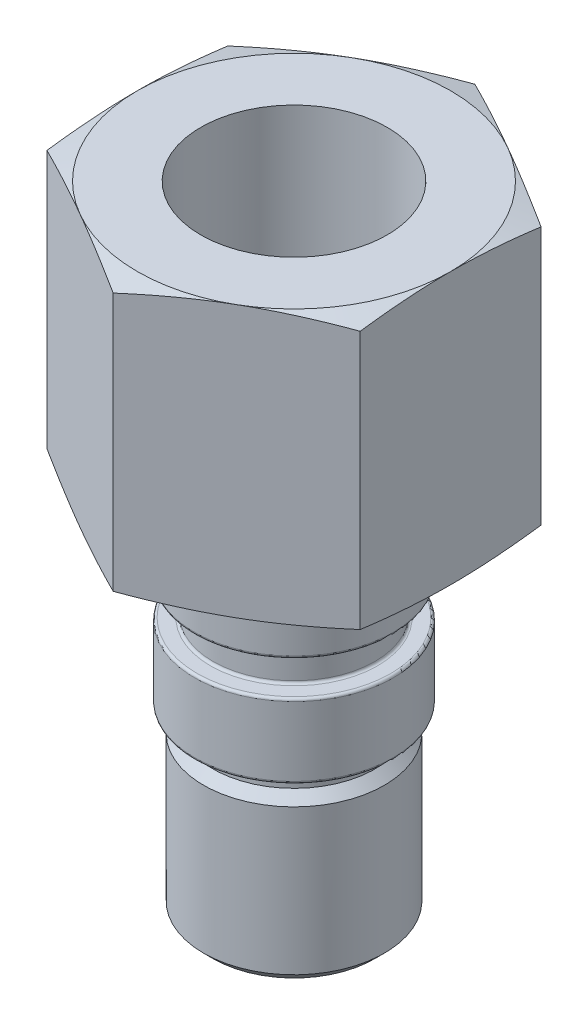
ISO-10303-21;
HEADER;
FILE_DESCRIPTION(('STEP AP214'),'2;1');
FILE_NAME('part.step','',(''),(''),'','','');
FILE_SCHEMA(('AUTOMOTIVE_DESIGN { 1 0 10303 214 1 1 1 1 }'));
ENDSEC;
DATA;
#1=APPLICATION_CONTEXT('core data for automotive mechanical design processes');
#2=APPLICATION_PROTOCOL_DEFINITION('international standard','automotive_design',2000,#1);
#3=PRODUCT_CONTEXT('',#1,'mechanical');
#4=PRODUCT('Part','Part','',(#3));
#5=PRODUCT_RELATED_PRODUCT_CATEGORY('part','',(#4));
#6=PRODUCT_DEFINITION_FORMATION('','',#4);
#7=PRODUCT_DEFINITION_CONTEXT('part definition',#1,'design');
#8=PRODUCT_DEFINITION('design','',#6,#7);
#9=PRODUCT_DEFINITION_SHAPE('','',#8);
#10=(LENGTH_UNIT() NAMED_UNIT(*) SI_UNIT(.MILLI.,.METRE.));
#11=(NAMED_UNIT(*) PLANE_ANGLE_UNIT() SI_UNIT($,.RADIAN.));
#12=(NAMED_UNIT(*) SI_UNIT($,.STERADIAN.) SOLID_ANGLE_UNIT());
#13=UNCERTAINTY_MEASURE_WITH_UNIT(LENGTH_MEASURE(1.E-05),#10,'distance_accuracy_value','');
#14=(GEOMETRIC_REPRESENTATION_CONTEXT(3) GLOBAL_UNCERTAINTY_ASSIGNED_CONTEXT((#13)) GLOBAL_UNIT_ASSIGNED_CONTEXT((#10,
#11,#12)) REPRESENTATION_CONTEXT('',''));
#15=CARTESIAN_POINT('',(0.,0.,0.));
#16=DIRECTION('',(0.,0.,1.));
#17=DIRECTION('',(1.,0.,0.));
#18=AXIS2_PLACEMENT_3D('',#15,#16,#17);
#19=CARTESIAN_POINT('',(0.,20.32,6.97738));
#20=DIRECTION('',(0.,-1.,0.));
#21=DIRECTION('',(0.,0.,-1.));
#22=AXIS2_PLACEMENT_3D('',#19,#20,#21);
#23=PLANE('',#22);
#24=CARTESIAN_POINT('',(0.,20.32,0.));
#25=DIRECTION('',(0.,1.,0.));
#26=DIRECTION('',(0.,0.,1.));
#27=AXIS2_PLACEMENT_3D('',#24,#25,#26);
#28=CIRCLE('',#27,6.79958);
#29=CARTESIAN_POINT('',(0.,20.32,6.79958));
#30=VERTEX_POINT('',#29);
#31=CARTESIAN_POINT('',(0.,20.32,-6.79958));
#32=VERTEX_POINT('',#31);
#33=EDGE_CURVE('E206',#30,#32,#28,.T.);
#34=ORIENTED_EDGE('',*,*,#33,.F.);
#35=CARTESIAN_POINT('',(0.,20.32,0.));
#36=DIRECTION('',(0.,1.,0.));
#37=DIRECTION('',(0.,0.,-1.));
#38=AXIS2_PLACEMENT_3D('',#35,#36,#37);
#39=CIRCLE('',#38,6.79958);
#40=EDGE_CURVE('E189',#32,#30,#39,.T.);
#41=ORIENTED_EDGE('',*,*,#40,.F.);
#42=EDGE_LOOP('',(#34,#41));
#43=FACE_BOUND('',#42,.T.);
#44=CARTESIAN_POINT('',(0.,20.32,0.));
#45=DIRECTION('',(0.,-1.,0.));
#46=DIRECTION('',(0.,0.,1.));
#47=AXIS2_PLACEMENT_3D('',#44,#45,#46);
#48=CIRCLE('',#47,5.8674);
#49=CARTESIAN_POINT('',(0.,20.32,-5.8674));
#50=VERTEX_POINT('',#49);
#51=CARTESIAN_POINT('',(0.,20.32,5.8674));
#52=VERTEX_POINT('',#51);
#53=EDGE_CURVE('E180',#50,#52,#48,.F.);
#54=ORIENTED_EDGE('',*,*,#53,.T.);
#55=CARTESIAN_POINT('',(0.,20.32,0.));
#56=DIRECTION('',(0.,-1.,0.));
#57=DIRECTION('',(0.,0.,-1.));
#58=AXIS2_PLACEMENT_3D('',#55,#56,#57);
#59=CIRCLE('',#58,5.8674);
#60=EDGE_CURVE('E183',#52,#50,#59,.F.);
#61=ORIENTED_EDGE('',*,*,#60,.T.);
#62=EDGE_LOOP('',(#54,#61));
#63=FACE_BOUND('',#62,.T.);
#64=ADVANCED_FACE('F17',(#43,#63),#23,.T.);
#65=CARTESIAN_POINT('',(0.,20.1422,0.));
#66=DIRECTION('',(0.,-1.,0.));
#67=DIRECTION('',(0.,0.,-1.));
#68=AXIS2_PLACEMENT_3D('',#65,#66,#67);
#69=TOROIDAL_SURFACE('',#68,5.8674,0.1778);
#70=CARTESIAN_POINT('',(0.,20.1422,0.));
#71=DIRECTION('',(0.,-1.,0.));
#72=DIRECTION('',(0.,0.,-1.));
#73=AXIS2_PLACEMENT_3D('',#70,#71,#72);
#74=CIRCLE('',#73,5.6896);
#75=CARTESIAN_POINT('',(0.,20.1422,-5.6896));
#76=VERTEX_POINT('',#75);
#77=EDGE_CURVE('E250',#76,#76,#74,.T.);
#78=ORIENTED_EDGE('',*,*,#77,.F.);
#79=EDGE_LOOP('',(#78));
#80=FACE_BOUND('',#79,.T.);
#81=ORIENTED_EDGE('',*,*,#53,.F.);
#82=ORIENTED_EDGE('',*,*,#60,.F.);
#83=EDGE_LOOP('',(#81,#82));
#84=FACE_BOUND('',#83,.T.);
#85=ADVANCED_FACE('F182',(#80,#84),#69,.F.);
#86=CARTESIAN_POINT('',(0.,20.4978,0.));
#87=DIRECTION('',(0.,-1.,0.));
#88=DIRECTION('',(0.,0.,-1.));
#89=AXIS2_PLACEMENT_3D('',#86,#87,#88);
#90=TOROIDAL_SURFACE('',#89,6.79958,0.1778);
#91=ORIENTED_EDGE('',*,*,#40,.T.);
#92=ORIENTED_EDGE('',*,*,#33,.T.);
#93=EDGE_LOOP('',(#91,#92));
#94=FACE_BOUND('',#93,.T.);
#95=CARTESIAN_POINT('',(0.,20.4978,0.));
#96=DIRECTION('',(0.,-1.,0.));
#97=DIRECTION('',(0.,0.,-1.));
#98=AXIS2_PLACEMENT_3D('',#95,#96,#97);
#99=CIRCLE('',#98,6.97738);
#100=CARTESIAN_POINT('',(0.,20.4978,-6.97738));
#101=VERTEX_POINT('',#100);
#102=EDGE_CURVE('E248',#101,#101,#99,.F.);
#103=ORIENTED_EDGE('',*,*,#102,.F.);
#104=EDGE_LOOP('',(#103));
#105=FACE_BOUND('',#104,.T.);
#106=ADVANCED_FACE('F230',(#94,#105),#90,.T.);
#107=CARTESIAN_POINT('',(0.,0.,0.));
#108=DIRECTION('',(0.,-1.,0.));
#109=DIRECTION('',(0.,0.,-1.));
#110=AXIS2_PLACEMENT_3D('',#107,#108,#109);
#111=CYLINDRICAL_SURFACE('',#110,5.6896);
#112=CARTESIAN_POINT('',(0.,18.0848,0.));
#113=DIRECTION('',(0.,1.,0.));
#114=DIRECTION('',(0.,0.,1.));
#115=AXIS2_PLACEMENT_3D('',#112,#113,#114);
#116=CIRCLE('',#115,5.6896);
#117=CARTESIAN_POINT('',(0.,18.0848,5.6896));
#118=VERTEX_POINT('',#117);
#119=EDGE_CURVE('E256',#118,#118,#116,.T.);
#120=ORIENTED_EDGE('',*,*,#119,.T.);
#121=EDGE_LOOP('',(#120));
#122=FACE_BOUND('',#121,.T.);
#123=ORIENTED_EDGE('',*,*,#77,.T.);
#124=EDGE_LOOP('',(#123));
#125=FACE_BOUND('',#124,.T.);
#126=ADVANCED_FACE('F240',(#122,#125),#111,.T.);
#127=CARTESIAN_POINT('',(0.,25.4,0.));
#128=DIRECTION('',(0.,-1.,0.));
#129=DIRECTION('',(0.,0.,-1.));
#130=AXIS2_PLACEMENT_3D('',#127,#128,#129);
#131=CYLINDRICAL_SURFACE('',#130,6.97738);
#132=ORIENTED_EDGE('',*,*,#102,.T.);
#133=EDGE_LOOP('',(#132));
#134=FACE_BOUND('',#133,.T.);
#135=CARTESIAN_POINT('',(0.,25.2222,0.));
#136=DIRECTION('',(0.,-1.,0.));
#137=DIRECTION('',(0.,0.,-1.));
#138=AXIS2_PLACEMENT_3D('',#135,#136,#137);
#139=CIRCLE('',#138,6.97738);
#140=CARTESIAN_POINT('',(0.,25.2222,-6.97738));
#141=VERTEX_POINT('',#140);
#142=EDGE_CURVE('E303',#141,#141,#139,.T.);
#143=ORIENTED_EDGE('',*,*,#142,.T.);
#144=EDGE_LOOP('',(#143));
#145=FACE_BOUND('',#144,.T.);
#146=ADVANCED_FACE('F284',(#134,#145),#131,.T.);
#147=CARTESIAN_POINT('',(0.,18.0848,0.));
#148=DIRECTION('',(0.,1.,0.));
#149=DIRECTION('',(0.,0.,1.));
#150=AXIS2_PLACEMENT_3D('',#147,#148,#149);
#151=TOROIDAL_SURFACE('',#150,5.8674,0.1778);
#152=ORIENTED_EDGE('',*,*,#119,.F.);
#153=EDGE_LOOP('',(#152));
#154=FACE_BOUND('',#153,.T.);
#155=CARTESIAN_POINT('',(0.,17.907,0.));
#156=DIRECTION('',(0.,1.,0.));
#157=DIRECTION('',(0.,0.,-1.));
#158=AXIS2_PLACEMENT_3D('',#155,#156,#157);
#159=CIRCLE('',#158,5.8674);
#160=CARTESIAN_POINT('',(0.,17.907,5.8674));
#161=VERTEX_POINT('',#160);
#162=CARTESIAN_POINT('',(0.,17.907,-5.8674));
#163=VERTEX_POINT('',#162);
#164=EDGE_CURVE('E310',#161,#163,#159,.F.);
#165=ORIENTED_EDGE('',*,*,#164,.F.);
#166=CARTESIAN_POINT('',(0.,17.907,0.));
#167=DIRECTION('',(0.,1.,0.));
#168=DIRECTION('',(0.,0.,1.));
#169=AXIS2_PLACEMENT_3D('',#166,#167,#168);
#170=CIRCLE('',#169,5.8674);
#171=EDGE_CURVE('E299',#163,#161,#170,.F.);
#172=ORIENTED_EDGE('',*,*,#171,.F.);
#173=EDGE_LOOP('',(#165,#172));
#174=FACE_BOUND('',#173,.T.);
#175=ADVANCED_FACE('F273',(#154,#174),#151,.F.);
#176=CARTESIAN_POINT('',(0.,25.2222,0.));
#177=DIRECTION('',(0.,-1.,0.));
#178=DIRECTION('',(0.,0.,-1.));
#179=AXIS2_PLACEMENT_3D('',#176,#177,#178);
#180=TOROIDAL_SURFACE('',#179,7.15518,0.1778);
#181=ORIENTED_EDGE('',*,*,#142,.F.);
#182=EDGE_LOOP('',(#181));
#183=FACE_BOUND('',#182,.T.);
#184=CARTESIAN_POINT('',(0.,25.4,0.));
#185=DIRECTION('',(0.,-1.,0.));
#186=DIRECTION('',(0.,0.,1.));
#187=AXIS2_PLACEMENT_3D('',#184,#185,#186);
#188=CIRCLE('',#187,7.15518);
#189=CARTESIAN_POINT('',(0.,25.4,-7.15518));
#190=VERTEX_POINT('',#189);
#191=CARTESIAN_POINT('',(0.,25.4,7.15518));
#192=VERTEX_POINT('',#191);
#193=EDGE_CURVE('E316',#190,#192,#188,.F.);
#194=ORIENTED_EDGE('',*,*,#193,.F.);
#195=CARTESIAN_POINT('',(0.,25.4,0.));
#196=DIRECTION('',(0.,-1.,0.));
#197=DIRECTION('',(0.,0.,-1.));
#198=AXIS2_PLACEMENT_3D('',#195,#196,#197);
#199=CIRCLE('',#198,7.15518);
#200=EDGE_CURVE('E318',#192,#190,#199,.F.);
#201=ORIENTED_EDGE('',*,*,#200,.F.);
#202=EDGE_LOOP('',(#194,#201));
#203=FACE_BOUND('',#202,.T.);
#204=ADVANCED_FACE('F283',(#183,#203),#180,.F.);
#205=CARTESIAN_POINT('',(0.,17.907,6.97738));
#206=DIRECTION('',(0.,1.,0.));
#207=DIRECTION('',(0.,0.,1.));
#208=AXIS2_PLACEMENT_3D('',#205,#206,#207);
#209=PLANE('',#208);
#210=CARTESIAN_POINT('',(0.,17.907,0.));
#211=DIRECTION('',(0.,-1.,0.));
#212=DIRECTION('',(0.,0.,-1.));
#213=AXIS2_PLACEMENT_3D('',#210,#211,#212);
#214=CIRCLE('',#213,6.79958);
#215=CARTESIAN_POINT('',(0.,17.907,-6.79958));
#216=VERTEX_POINT('',#215);
#217=CARTESIAN_POINT('',(0.,17.907,6.79958));
#218=VERTEX_POINT('',#217);
#219=EDGE_CURVE('E323',#216,#218,#214,.T.);
#220=ORIENTED_EDGE('',*,*,#219,.F.);
#221=CARTESIAN_POINT('',(0.,17.907,0.));
#222=DIRECTION('',(0.,-1.,0.));
#223=DIRECTION('',(0.,0.,1.));
#224=AXIS2_PLACEMENT_3D('',#221,#222,#223);
#225=CIRCLE('',#224,6.79958);
#226=EDGE_CURVE('E325',#218,#216,#225,.T.);
#227=ORIENTED_EDGE('',*,*,#226,.F.);
#228=EDGE_LOOP('',(#220,#227));
#229=FACE_BOUND('',#228,.T.);
#230=ORIENTED_EDGE('',*,*,#164,.T.);
#231=ORIENTED_EDGE('',*,*,#171,.T.);
#232=EDGE_LOOP('',(#230,#231));
#233=FACE_BOUND('',#232,.T.);
#234=ADVANCED_FACE('F389',(#229,#233),#209,.T.);
#235=CARTESIAN_POINT('',(0.,25.4,0.));
#236=DIRECTION('',(0.,-1.,0.));
#237=DIRECTION('',(0.,0.,-1.));
#238=AXIS2_PLACEMENT_3D('',#235,#236,#237);
#239=PLANE('',#238);
#240=ORIENTED_EDGE('',*,*,#193,.T.);
#241=ORIENTED_EDGE('',*,*,#200,.T.);
#242=EDGE_LOOP('',(#240,#241));
#243=FACE_BOUND('',#242,.T.);
#244=CARTESIAN_POINT('',(0.,25.4,0.));
#245=DIRECTION('',(0.,1.,0.));
#246=DIRECTION('',(0.,0.,1.));
#247=AXIS2_PLACEMENT_3D('',#244,#245,#246);
#248=CIRCLE('',#247,7.62);
#249=CARTESIAN_POINT('',(0.,25.4,7.62));
#250=VERTEX_POINT('',#249);
#251=CARTESIAN_POINT('',(0.,25.4,-7.62));
#252=VERTEX_POINT('',#251);
#253=EDGE_CURVE('E332',#250,#252,#248,.T.);
#254=ORIENTED_EDGE('',*,*,#253,.F.);
#255=CARTESIAN_POINT('',(0.,25.4,0.));
#256=DIRECTION('',(0.,1.,0.));
#257=DIRECTION('',(0.,0.,-1.));
#258=AXIS2_PLACEMENT_3D('',#255,#256,#257);
#259=CIRCLE('',#258,7.62);
#260=EDGE_CURVE('E330',#252,#250,#259,.T.);
#261=ORIENTED_EDGE('',*,*,#260,.F.);
#262=EDGE_LOOP('',(#254,#261));
#263=FACE_BOUND('',#262,.T.);
#264=ADVANCED_FACE('F360',(#243,#263),#239,.T.);
#265=CARTESIAN_POINT('',(0.,17.7292,0.));
#266=DIRECTION('',(0.,1.,0.));
#267=DIRECTION('',(0.,0.,1.));
#268=AXIS2_PLACEMENT_3D('',#265,#266,#267);
#269=TOROIDAL_SURFACE('',#268,6.79958,0.1778);
#270=CARTESIAN_POINT('',(0.,17.7292,0.));
#271=DIRECTION('',(0.,-1.,0.));
#272=DIRECTION('',(0.,0.,-1.));
#273=AXIS2_PLACEMENT_3D('',#270,#271,#272);
#274=CIRCLE('',#273,6.97738);
#275=CARTESIAN_POINT('',(0.,17.7292,-6.97738));
#276=VERTEX_POINT('',#275);
#277=EDGE_CURVE('E337',#276,#276,#274,.T.);
#278=ORIENTED_EDGE('',*,*,#277,.F.);
#279=EDGE_LOOP('',(#278));
#280=FACE_BOUND('',#279,.T.);
#281=ORIENTED_EDGE('',*,*,#226,.T.);
#282=ORIENTED_EDGE('',*,*,#219,.T.);
#283=EDGE_LOOP('',(#281,#282));
#284=FACE_BOUND('',#283,.T.);
#285=ADVANCED_FACE('F354',(#280,#284),#269,.T.);
#286=CARTESIAN_POINT('',(0.,25.5778,0.));
#287=DIRECTION('',(0.,-1.,0.));
#288=DIRECTION('',(0.,0.,-1.));
#289=AXIS2_PLACEMENT_3D('',#286,#287,#288);
#290=TOROIDAL_SURFACE('',#289,7.62,0.1778);
#291=ORIENTED_EDGE('',*,*,#260,.T.);
#292=ORIENTED_EDGE('',*,*,#253,.T.);
#293=EDGE_LOOP('',(#291,#292));
#294=FACE_BOUND('',#293,.T.);
#295=CARTESIAN_POINT('',(0.,25.5778,0.));
#296=DIRECTION('',(0.,-1.,0.));
#297=DIRECTION('',(0.,0.,-1.));
#298=AXIS2_PLACEMENT_3D('',#295,#296,#297);
#299=CIRCLE('',#298,7.7978);
#300=CARTESIAN_POINT('',(0.,25.5778,-7.7978));
#301=VERTEX_POINT('',#300);
#302=EDGE_CURVE('E340',#301,#301,#299,.F.);
#303=ORIENTED_EDGE('',*,*,#302,.F.);
#304=EDGE_LOOP('',(#303));
#305=FACE_BOUND('',#304,.T.);
#306=ADVANCED_FACE('F359',(#294,#305),#290,.T.);
#307=CARTESIAN_POINT('',(0.,25.4,0.));
#308=DIRECTION('',(0.,-1.,0.));
#309=DIRECTION('',(0.,0.,-1.));
#310=AXIS2_PLACEMENT_3D('',#307,#308,#309);
#311=CYLINDRICAL_SURFACE('',#310,6.97738);
#312=ORIENTED_EDGE('',*,*,#277,.T.);
#313=EDGE_LOOP('',(#312));
#314=FACE_BOUND('',#313,.T.);
#315=CARTESIAN_POINT('',(0.,12.8778,0.));
#316=DIRECTION('',(0.,-1.,0.));
#317=DIRECTION('',(0.,0.,-1.));
#318=AXIS2_PLACEMENT_3D('',#315,#316,#317);
#319=CIRCLE('',#318,6.97738);
#320=CARTESIAN_POINT('',(0.,12.8778,-6.97738));
#321=VERTEX_POINT('',#320);
#322=EDGE_CURVE('E345',#321,#321,#319,.T.);
#323=ORIENTED_EDGE('',*,*,#322,.F.);
#324=EDGE_LOOP('',(#323));
#325=FACE_BOUND('',#324,.T.);
#326=ADVANCED_FACE('F764',(#314,#325),#311,.T.);
#327=CARTESIAN_POINT('',(0.,26.6954,0.));
#328=DIRECTION('',(0.,-1.,0.));
#329=DIRECTION('',(0.,0.,-1.));
#330=AXIS2_PLACEMENT_3D('',#327,#328,#329);
#331=CYLINDRICAL_SURFACE('',#330,7.7978);
#332=ORIENTED_EDGE('',*,*,#302,.T.);
#333=EDGE_LOOP('',(#332));
#334=FACE_BOUND('',#333,.T.);
#335=CARTESIAN_POINT('',(0.,26.5176,0.));
#336=DIRECTION('',(0.,-1.,0.));
#337=DIRECTION('',(0.,0.,-1.));
#338=AXIS2_PLACEMENT_3D('',#335,#336,#337);
#339=CIRCLE('',#338,7.7978);
#340=CARTESIAN_POINT('',(0.,26.5176,-7.7978));
#341=VERTEX_POINT('',#340);
#342=EDGE_CURVE('E745',#341,#341,#339,.T.);
#343=ORIENTED_EDGE('',*,*,#342,.T.);
#344=EDGE_LOOP('',(#343));
#345=FACE_BOUND('',#344,.T.);
#346=ADVANCED_FACE('F766',(#334,#345),#331,.T.);
#347=CARTESIAN_POINT('',(0.,12.8778,0.));
#348=DIRECTION('',(0.,-1.,0.));
#349=DIRECTION('',(0.,0.,-1.));
#350=AXIS2_PLACEMENT_3D('',#347,#348,#349);
#351=TOROIDAL_SURFACE('',#350,6.79958,0.1778);
#352=ORIENTED_EDGE('',*,*,#322,.T.);
#353=EDGE_LOOP('',(#352));
#354=FACE_BOUND('',#353,.T.);
#355=CARTESIAN_POINT('',(0.,12.7,0.));
#356=DIRECTION('',(0.,1.,0.));
#357=DIRECTION('',(0.,0.,-1.));
#358=AXIS2_PLACEMENT_3D('',#355,#356,#357);
#359=CIRCLE('',#358,6.79958);
#360=CARTESIAN_POINT('',(0.,12.7,6.79958));
#361=VERTEX_POINT('',#360);
#362=CARTESIAN_POINT('',(0.,12.7,-6.79958));
#363=VERTEX_POINT('',#362);
#364=EDGE_CURVE('E696',#361,#363,#359,.F.);
#365=ORIENTED_EDGE('',*,*,#364,.F.);
#366=CARTESIAN_POINT('',(0.,12.7,0.));
#367=DIRECTION('',(0.,1.,0.));
#368=DIRECTION('',(0.,0.,1.));
#369=AXIS2_PLACEMENT_3D('',#366,#367,#368);
#370=CIRCLE('',#369,6.79958);
#371=EDGE_CURVE('E685',#363,#361,#370,.F.);
#372=ORIENTED_EDGE('',*,*,#371,.F.);
#373=EDGE_LOOP('',(#365,#372));
#374=FACE_BOUND('',#373,.T.);
#375=ADVANCED_FACE('F712',(#354,#374),#351,.T.);
#376=CARTESIAN_POINT('',(0.,26.5176,0.));
#377=DIRECTION('',(0.,-1.,0.));
#378=DIRECTION('',(0.,0.,-1.));
#379=AXIS2_PLACEMENT_3D('',#376,#377,#378);
#380=TOROIDAL_SURFACE('',#379,7.9756,0.1778);
#381=ORIENTED_EDGE('',*,*,#342,.F.);
#382=EDGE_LOOP('',(#381));
#383=FACE_BOUND('',#382,.T.);
#384=CARTESIAN_POINT('',(0.,26.6954,0.));
#385=DIRECTION('',(0.,-1.,0.));
#386=DIRECTION('',(0.,0.,1.));
#387=AXIS2_PLACEMENT_3D('',#384,#385,#386);
#388=CIRCLE('',#387,7.9756);
#389=CARTESIAN_POINT('',(0.,26.6954,-7.9756));
#390=VERTEX_POINT('',#389);
#391=CARTESIAN_POINT('',(0.,26.6954,7.9756));
#392=VERTEX_POINT('',#391);
#393=EDGE_CURVE('E631',#390,#392,#388,.F.);
#394=ORIENTED_EDGE('',*,*,#393,.F.);
#395=CARTESIAN_POINT('',(0.,26.6954,0.));
#396=DIRECTION('',(0.,-1.,0.));
#397=DIRECTION('',(0.,0.,-1.));
#398=AXIS2_PLACEMENT_3D('',#395,#396,#397);
#399=CIRCLE('',#398,7.9756);
#400=EDGE_CURVE('E1274',#392,#390,#399,.F.);
#401=ORIENTED_EDGE('',*,*,#400,.F.);
#402=EDGE_LOOP('',(#394,#401));
#403=FACE_BOUND('',#402,.T.);
#404=ADVANCED_FACE('F708',(#383,#403),#380,.F.);
#405=CARTESIAN_POINT('',(0.,12.7,6.97738));
#406=DIRECTION('',(0.,-1.,0.));
#407=DIRECTION('',(0.,0.,-1.));
#408=AXIS2_PLACEMENT_3D('',#405,#406,#407);
#409=PLANE('',#408);
#410=CARTESIAN_POINT('',(0.,12.7,0.));
#411=DIRECTION('',(0.,-1.,0.));
#412=DIRECTION('',(0.,0.,-1.));
#413=AXIS2_PLACEMENT_3D('',#410,#411,#412);
#414=CIRCLE('',#413,5.6896);
#415=CARTESIAN_POINT('',(0.,12.7,-5.6896));
#416=VERTEX_POINT('',#415);
#417=EDGE_CURVE('E1272',#416,#416,#414,.T.);
#418=ORIENTED_EDGE('',*,*,#417,.F.);
#419=EDGE_LOOP('',(#418));
#420=FACE_BOUND('',#419,.T.);
#421=ORIENTED_EDGE('',*,*,#371,.T.);
#422=ORIENTED_EDGE('',*,*,#364,.T.);
#423=EDGE_LOOP('',(#421,#422));
#424=FACE_BOUND('',#423,.T.);
#425=ADVANCED_FACE('F646',(#420,#424),#409,.T.);
#426=CARTESIAN_POINT('',(0.,26.6954,0.));
#427=DIRECTION('',(0.,-1.,0.));
#428=DIRECTION('',(0.,0.,-1.));
#429=AXIS2_PLACEMENT_3D('',#426,#427,#428);
#430=PLANE('',#429);
#431=CARTESIAN_POINT('',(0.,26.6954,0.));
#432=DIRECTION('',(0.,1.,0.));
#433=DIRECTION('',(0.,0.,1.));
#434=AXIS2_PLACEMENT_3D('',#431,#432,#433);
#435=CIRCLE('',#434,10.033);
#436=CARTESIAN_POINT('',(0.,26.6954,-10.033));
#437=VERTEX_POINT('',#436);
#438=CARTESIAN_POINT('',(0.,26.6954,10.033));
#439=VERTEX_POINT('',#438);
#440=EDGE_CURVE('E628',#437,#439,#435,.F.);
#441=ORIENTED_EDGE('',*,*,#440,.T.);
#442=CARTESIAN_POINT('',(0.,26.6954,0.));
#443=DIRECTION('',(0.,1.,0.));
#444=DIRECTION('',(0.,0.,-1.));
#445=AXIS2_PLACEMENT_3D('',#442,#443,#444);
#446=CIRCLE('',#445,10.033);
#447=EDGE_CURVE('E596',#439,#437,#446,.F.);
#448=ORIENTED_EDGE('',*,*,#447,.T.);
#449=EDGE_LOOP('',(#441,#448));
#450=FACE_BOUND('',#449,.T.);
#451=ORIENTED_EDGE('',*,*,#393,.T.);
#452=ORIENTED_EDGE('',*,*,#400,.T.);
#453=EDGE_LOOP('',(#451,#452));
#454=FACE_BOUND('',#453,.T.);
#455=ADVANCED_FACE('F637',(#450,#454),#430,.T.);
#456=CARTESIAN_POINT('',(0.,0.,0.));
#457=DIRECTION('',(0.,-1.,0.));
#458=DIRECTION('',(0.,0.,-1.));
#459=AXIS2_PLACEMENT_3D('',#456,#457,#458);
#460=CYLINDRICAL_SURFACE('',#459,5.6896);
#461=ORIENTED_EDGE('',*,*,#417,.T.);
#462=EDGE_LOOP('',(#461));
#463=FACE_BOUND('',#462,.T.);
#464=CARTESIAN_POINT('',(0.,11.5442999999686,0.));
#465=DIRECTION('',(0.,-1.,0.));
#466=DIRECTION('',(0.,0.,-1.));
#467=AXIS2_PLACEMENT_3D('',#464,#465,#466);
#468=CIRCLE('',#467,5.68959999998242);
#469=CARTESIAN_POINT('',(0.,11.5442999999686,-5.68959999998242));
#470=VERTEX_POINT('',#469);
#471=EDGE_CURVE('E625',#470,#470,#468,.T.);
#472=ORIENTED_EDGE('',*,*,#471,.F.);
#473=EDGE_LOOP('',(#472));
#474=FACE_BOUND('',#473,.T.);
#475=ADVANCED_FACE('F616',(#463,#474),#460,.T.);
#476=CARTESIAN_POINT('',(0.,26.5176,0.));
#477=DIRECTION('',(0.,-1.,0.));
#478=DIRECTION('',(0.,0.,-1.));
#479=AXIS2_PLACEMENT_3D('',#476,#477,#478);
#480=TOROIDAL_SURFACE('',#479,10.033,0.1778);
#481=ORIENTED_EDGE('',*,*,#440,.F.);
#482=ORIENTED_EDGE('',*,*,#447,.F.);
#483=EDGE_LOOP('',(#481,#482));
#484=FACE_BOUND('',#483,.T.);
#485=CARTESIAN_POINT('',(0.,26.5176,0.));
#486=DIRECTION('',(0.,-1.,0.));
#487=DIRECTION('',(0.,0.,-1.));
#488=AXIS2_PLACEMENT_3D('',#485,#486,#487);
#489=CIRCLE('',#488,10.2108);
#490=CARTESIAN_POINT('',(0.,26.5176,-10.2108));
#491=VERTEX_POINT('',#490);
#492=EDGE_CURVE('E623',#491,#491,#489,.T.);
#493=ORIENTED_EDGE('',*,*,#492,.T.);
#494=EDGE_LOOP('',(#493));
#495=FACE_BOUND('',#494,.T.);
#496=ADVANCED_FACE('F604',(#484,#495),#480,.F.);
#497=CARTESIAN_POINT('',(0.,10.8838999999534,0.));
#498=DIRECTION('',(0.,-1.,0.));
#499=DIRECTION('',(0.,0.,-1.));
#500=AXIS2_PLACEMENT_3D('',#497,#498,#499);
#501=CONICAL_SURFACE('',#500,6.34999999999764,0.785398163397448);
#502=ORIENTED_EDGE('',*,*,#471,.T.);
#503=EDGE_LOOP('',(#502));
#504=FACE_BOUND('',#503,.T.);
#505=CARTESIAN_POINT('',(0.,10.8839,0.));
#506=DIRECTION('',(0.,-1.,0.));
#507=DIRECTION('',(0.,0.,-1.));
#508=AXIS2_PLACEMENT_3D('',#505,#506,#507);
#509=CIRCLE('',#508,6.35);
#510=CARTESIAN_POINT('',(0.,10.8839,-6.35));
#511=VERTEX_POINT('',#510);
#512=EDGE_CURVE('E1282',#511,#511,#509,.T.);
#513=ORIENTED_EDGE('',*,*,#512,.F.);
#514=EDGE_LOOP('',(#513));
#515=FACE_BOUND('',#514,.T.);
#516=ADVANCED_FACE('F615',(#504,#515),#501,.T.);
#517=CARTESIAN_POINT('',(0.,26.6954,0.));
#518=DIRECTION('',(0.,-1.,0.));
#519=DIRECTION('',(0.,0.,-1.));
#520=AXIS2_PLACEMENT_3D('',#517,#518,#519);
#521=CYLINDRICAL_SURFACE('',#520,10.2108);
#522=ORIENTED_EDGE('',*,*,#492,.F.);
#523=EDGE_LOOP('',(#522));
#524=FACE_BOUND('',#523,.T.);
#525=CARTESIAN_POINT('',(0.,25.5778,0.));
#526=DIRECTION('',(0.,-1.,0.));
#527=DIRECTION('',(0.,0.,-1.));
#528=AXIS2_PLACEMENT_3D('',#525,#526,#527);
#529=CIRCLE('',#528,10.2108);
#530=CARTESIAN_POINT('',(0.,25.5778,-10.2108));
#531=VERTEX_POINT('',#530);
#532=EDGE_CURVE('E1283',#531,#531,#529,.F.);
#533=ORIENTED_EDGE('',*,*,#532,.F.);
#534=EDGE_LOOP('',(#533));
#535=FACE_BOUND('',#534,.T.);
#536=ADVANCED_FACE('F904',(#524,#535),#521,.F.);
#537=CARTESIAN_POINT('',(0.,0.,0.));
#538=DIRECTION('',(0.,-1.,0.));
#539=DIRECTION('',(0.,0.,-1.));
#540=AXIS2_PLACEMENT_3D('',#537,#538,#539);
#541=CYLINDRICAL_SURFACE('',#540,6.35);
#542=ORIENTED_EDGE('',*,*,#512,.T.);
#543=EDGE_LOOP('',(#542));
#544=FACE_BOUND('',#543,.T.);
#545=CARTESIAN_POINT('',(0.,0.673100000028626,0.));
#546=DIRECTION('',(0.,1.,0.));
#547=DIRECTION('',(0.,0.,1.));
#548=AXIS2_PLACEMENT_3D('',#545,#546,#547);
#549=CIRCLE('',#548,6.35000000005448);
#550=CARTESIAN_POINT('',(0.,0.673100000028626,6.35000000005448));
#551=VERTEX_POINT('',#550);
#552=EDGE_CURVE('E1285',#551,#551,#549,.F.);
#553=ORIENTED_EDGE('',*,*,#552,.F.);
#554=EDGE_LOOP('',(#553));
#555=FACE_BOUND('',#554,.T.);
#556=ADVANCED_FACE('F575',(#544,#555),#541,.T.);
#557=CARTESIAN_POINT('',(0.,25.5778,0.));
#558=DIRECTION('',(0.,-1.,0.));
#559=DIRECTION('',(0.,0.,-1.));
#560=AXIS2_PLACEMENT_3D('',#557,#558,#559);
#561=TOROIDAL_SURFACE('',#560,10.3886,0.1778);
#562=ORIENTED_EDGE('',*,*,#532,.T.);
#563=EDGE_LOOP('',(#562));
#564=FACE_BOUND('',#563,.T.);
#565=CARTESIAN_POINT('',(0.,25.4,0.));
#566=DIRECTION('',(0.,-1.,0.));
#567=DIRECTION('',(0.,0.,-1.));
#568=AXIS2_PLACEMENT_3D('',#565,#566,#567);
#569=CIRCLE('',#568,10.3886);
#570=CARTESIAN_POINT('',(0.,25.4,10.3886));
#571=VERTEX_POINT('',#570);
#572=CARTESIAN_POINT('',(0.,25.4,-10.3886));
#573=VERTEX_POINT('',#572);
#574=EDGE_CURVE('E1269',#571,#573,#569,.F.);
#575=ORIENTED_EDGE('',*,*,#574,.F.);
#576=CARTESIAN_POINT('',(0.,25.4,0.));
#577=DIRECTION('',(0.,-1.,0.));
#578=DIRECTION('',(0.,0.,1.));
#579=AXIS2_PLACEMENT_3D('',#576,#577,#578);
#580=CIRCLE('',#579,10.3886);
#581=EDGE_CURVE('E121',#573,#571,#580,.F.);
#582=ORIENTED_EDGE('',*,*,#581,.F.);
#583=EDGE_LOOP('',(#575,#582));
#584=FACE_BOUND('',#583,.T.);
#585=ADVANCED_FACE('F571',(#564,#584),#561,.T.);
#586=CARTESIAN_POINT('',(0.,0.673100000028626,0.));
#587=DIRECTION('',(0.,1.,0.));
#588=DIRECTION('',(0.,0.,1.));
#589=AXIS2_PLACEMENT_3D('',#586,#587,#588);
#590=CONICAL_SURFACE('',#589,6.35000000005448,0.785398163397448);
#591=CARTESIAN_POINT('',(0.,0.,0.));
#592=DIRECTION('',(0.,1.,0.));
#593=DIRECTION('',(0.,0.,1.));
#594=AXIS2_PLACEMENT_3D('',#591,#592,#593);
#595=CIRCLE('',#594,5.67690000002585);
#596=CARTESIAN_POINT('',(0.,0.,5.67690000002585));
#597=VERTEX_POINT('',#596);
#598=EDGE_CURVE('E1264',#597,#597,#595,.T.);
#599=ORIENTED_EDGE('',*,*,#598,.T.);
#600=EDGE_LOOP('',(#599));
#601=FACE_BOUND('',#600,.T.);
#602=ORIENTED_EDGE('',*,*,#552,.T.);
#603=EDGE_LOOP('',(#602));
#604=FACE_BOUND('',#603,.T.);
#605=ADVANCED_FACE('F556',(#601,#604),#590,.T.);
#606=CARTESIAN_POINT('',(0.,25.4,0.));
#607=DIRECTION('',(0.,-1.,0.));
#608=DIRECTION('',(0.,0.,-1.));
#609=AXIS2_PLACEMENT_3D('',#606,#607,#608);
#610=PLANE('',#609);
#611=CARTESIAN_POINT('',(0.,25.4,0.));
#612=DIRECTION('',(0.,1.,0.));
#613=DIRECTION('',(0.,0.,1.));
#614=AXIS2_PLACEMENT_3D('',#611,#612,#613);
#615=CIRCLE('',#614,10.9982);
#616=CARTESIAN_POINT('',(-10.9982,25.4,0.));
#617=VERTEX_POINT('',#616);
#618=CARTESIAN_POINT('',(-5.4991,25.4,9.52472059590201));
#619=VERTEX_POINT('',#618);
#620=EDGE_CURVE('E1300',#617,#619,#615,.T.);
#621=ORIENTED_EDGE('',*,*,#620,.F.);
#622=CARTESIAN_POINT('',(0.,25.4,0.));
#623=DIRECTION('',(0.,1.,0.));
#624=DIRECTION('',(0.,0.,1.));
#625=AXIS2_PLACEMENT_3D('',#622,#623,#624);
#626=CIRCLE('',#625,10.9982);
#627=CARTESIAN_POINT('',(-5.49909999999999,25.4,-9.52472059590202));
#628=VERTEX_POINT('',#627);
#629=EDGE_CURVE('E1298',#628,#617,#626,.T.);
#630=ORIENTED_EDGE('',*,*,#629,.F.);
#631=CARTESIAN_POINT('',(0.,25.4,0.));
#632=DIRECTION('',(0.,1.,0.));
#633=DIRECTION('',(0.,0.,1.));
#634=AXIS2_PLACEMENT_3D('',#631,#632,#633);
#635=CIRCLE('',#634,10.9982);
#636=CARTESIAN_POINT('',(5.4991,25.4,-9.52472059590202));
#637=VERTEX_POINT('',#636);
#638=EDGE_CURVE('E1266',#637,#628,#635,.T.);
#639=ORIENTED_EDGE('',*,*,#638,.F.);
#640=CARTESIAN_POINT('',(0.,25.4,0.));
#641=DIRECTION('',(0.,1.,0.));
#642=DIRECTION('',(0.,0.,1.));
#643=AXIS2_PLACEMENT_3D('',#640,#641,#642);
#644=CIRCLE('',#643,10.9982);
#645=CARTESIAN_POINT('',(10.9982,25.4,0.));
#646=VERTEX_POINT('',#645);
#647=EDGE_CURVE('E1263',#646,#637,#644,.T.);
#648=ORIENTED_EDGE('',*,*,#647,.F.);
#649=CARTESIAN_POINT('',(0.,25.4,0.));
#650=DIRECTION('',(0.,1.,0.));
#651=DIRECTION('',(0.,0.,1.));
#652=AXIS2_PLACEMENT_3D('',#649,#650,#651);
#653=CIRCLE('',#652,10.9982);
#654=CARTESIAN_POINT('',(5.4991,25.4,9.52472059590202));
#655=VERTEX_POINT('',#654);
#656=EDGE_CURVE('E106',#655,#646,#653,.T.);
#657=ORIENTED_EDGE('',*,*,#656,.F.);
#658=CARTESIAN_POINT('',(0.,25.4,0.));
#659=DIRECTION('',(0.,1.,0.));
#660=DIRECTION('',(0.,0.,1.));
#661=AXIS2_PLACEMENT_3D('',#658,#659,#660);
#662=CIRCLE('',#661,10.9982);
#663=EDGE_CURVE('E113',#619,#655,#662,.T.);
#664=ORIENTED_EDGE('',*,*,#663,.F.);
#665=EDGE_LOOP('',(#621,#630,#639,#648,#657,#664));
#666=FACE_BOUND('',#665,.T.);
#667=ORIENTED_EDGE('',*,*,#581,.T.);
#668=ORIENTED_EDGE('',*,*,#574,.T.);
#669=EDGE_LOOP('',(#667,#668));
#670=FACE_BOUND('',#669,.T.);
#671=ADVANCED_FACE('F545',(#666,#670),#610,.T.);
#672=CARTESIAN_POINT('',(0.,0.,0.));
#673=DIRECTION('',(0.,1.,0.));
#674=DIRECTION('',(0.,0.,1.));
#675=AXIS2_PLACEMENT_3D('',#672,#673,#674);
#676=PLANE('',#675);
#677=ORIENTED_EDGE('',*,*,#598,.F.);
#678=EDGE_LOOP('',(#677));
#679=FACE_BOUND('',#678,.T.);
#680=CARTESIAN_POINT('',(0.,0.,0.));
#681=DIRECTION('',(0.,-1.,0.));
#682=DIRECTION('',(0.,0.,-1.));
#683=AXIS2_PLACEMENT_3D('',#680,#681,#682);
#684=CIRCLE('',#683,3.5687);
#685=CARTESIAN_POINT('',(0.,0.,-3.5687));
#686=VERTEX_POINT('',#685);
#687=EDGE_CURVE('E1260',#686,#686,#684,.F.);
#688=ORIENTED_EDGE('',*,*,#687,.T.);
#689=EDGE_LOOP('',(#688));
#690=FACE_BOUND('',#689,.T.);
#691=ADVANCED_FACE('F555',(#679,#690),#676,.F.);
#692=CARTESIAN_POINT('',(0.,25.8586314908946,0.));
#693=DIRECTION('',(0.,1.,0.));
#694=DIRECTION('',(0.,0.,1.));
#695=AXIS2_PLACEMENT_3D('',#692,#693,#694);
#696=CONICAL_SURFACE('',#695,12.7098360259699,1.30899693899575);
#697=ORIENTED_EDGE('',*,*,#656,.T.);
#698=CARTESIAN_POINT('',(10.9982,25.4,0.));
#699=CARTESIAN_POINT('',(10.9982,25.3999848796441,0.26564883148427));
#700=CARTESIAN_POINT('',(10.9982,25.4025786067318,0.531295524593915));
#701=CARTESIAN_POINT('',(10.9982,25.4128724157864,1.06248175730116));
#702=CARTESIAN_POINT('',(10.9982,25.4205723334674,1.32802130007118));
#703=CARTESIAN_POINT('',(10.9982,25.4409556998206,1.85860818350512));
#704=CARTESIAN_POINT('',(10.9982,25.4536335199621,2.12365574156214));
#705=CARTESIAN_POINT('',(10.9982,25.4837621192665,2.65347821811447));
#706=CARTESIAN_POINT('',(10.9982,25.5012129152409,2.91825313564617));
#707=CARTESIAN_POINT('',(10.9982,25.5603379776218,3.71192774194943));
#708=CARTESIAN_POINT('',(10.9982,25.6087908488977,4.24032474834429));
#709=CARTESIAN_POINT('',(10.9982,25.7212838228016,5.29607818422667));
#710=CARTESIAN_POINT('',(10.9982,25.7853416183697,5.82343274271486));
#711=CARTESIAN_POINT('',(10.9982,25.8558961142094,6.34981373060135));
#712=B_SPLINE_CURVE_WITH_KNOTS('',3,(#698,#699,#700,#701,#702,#703,#704,#705,#706,#707,#708,
#709,#710,#711),.UNSPECIFIED.,.F.,.F.,(4,2,2,2,2,2,4),(0.,0.796930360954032,1.59383508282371,
2.38984132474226,3.18585037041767,4.7774259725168,6.37081457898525),.UNSPECIFIED.);
#713=CARTESIAN_POINT('',(10.9982,25.8558961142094,6.34981373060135));
#714=VERTEX_POINT('',#713);
#715=EDGE_CURVE('E530',#646,#714,#712,.T.);
#716=ORIENTED_EDGE('',*,*,#715,.T.);
#717=CARTESIAN_POINT('',(10.9982,25.8558961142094,6.34981373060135));
#718=CARTESIAN_POINT('',(10.5423406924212,25.7853416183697,6.61300422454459));
#719=CARTESIAN_POINT('',(10.0856382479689,25.7212838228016,6.87668150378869));
#720=CARTESIAN_POINT('',(9.17132895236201,25.6087908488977,7.40455822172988));
#721=CARTESIAN_POINT('',(8.71372372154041,25.5603379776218,7.66875672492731));
#722=CARTESIAN_POINT('',(8.02638135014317,25.5012129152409,8.06559402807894));
#723=CARTESIAN_POINT('',(7.79707954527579,25.4837621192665,8.19798148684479));
#724=CARTESIAN_POINT('',(7.33823982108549,25.4536335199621,8.46289272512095));
#725=CARTESIAN_POINT('',(7.10870190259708,25.4409556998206,8.59541650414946));
#726=CARTESIAN_POINT('',(6.64920018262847,25.4205723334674,8.86070994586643));
#727=CARTESIAN_POINT('',(6.41923619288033,25.4128724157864,8.99347971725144));
#728=CARTESIAN_POINT('',(5.95921542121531,25.4025786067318,9.25907283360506));
#729=CARTESIAN_POINT('',(5.72915863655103,25.3999848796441,9.39189618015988));
#730=CARTESIAN_POINT('',(5.4991,25.4,9.52472059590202));
#731=B_SPLINE_CURVE_WITH_KNOTS('',3,(#717,#718,#719,#720,#721,#722,#723,#724,#725,#726,#727,
#728,#729,#730),.UNSPECIFIED.,.F.,.F.,(4,2,2,2,2,2,4),(0.,1.59338860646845,3.18496420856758,
3.98097325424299,4.77697949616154,5.57388421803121,6.37081457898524),.UNSPECIFIED.);
#732=EDGE_CURVE('E1182',#714,#655,#731,.T.);
#733=ORIENTED_EDGE('',*,*,#732,.T.);
#734=EDGE_LOOP('',(#697,#716,#733));
#735=FACE_BOUND('',#734,.T.);
#736=ADVANCED_FACE('F943',(#735),#696,.T.);
#737=CARTESIAN_POINT('',(0.,25.8586314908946,0.));
#738=DIRECTION('',(0.,1.,0.));
#739=DIRECTION('',(0.,0.,1.));
#740=AXIS2_PLACEMENT_3D('',#737,#738,#739);
#741=CONICAL_SURFACE('',#740,12.7098360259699,1.30899693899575);
#742=ORIENTED_EDGE('',*,*,#647,.T.);
#743=CARTESIAN_POINT('',(5.4991,25.4,-9.52472059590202));
#744=CARTESIAN_POINT('',(5.72915863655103,25.3999848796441,-9.39189618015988));
#745=CARTESIAN_POINT('',(5.95921542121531,25.4025786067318,-9.25907283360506));
#746=CARTESIAN_POINT('',(6.41923619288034,25.4128724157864,-8.99347971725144));
#747=CARTESIAN_POINT('',(6.64920018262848,25.4205723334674,-8.86070994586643));
#748=CARTESIAN_POINT('',(7.10870190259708,25.4409556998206,-8.59541650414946));
#749=CARTESIAN_POINT('',(7.33823982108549,25.4536335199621,-8.46289272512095));
#750=CARTESIAN_POINT('',(7.79707954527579,25.4837621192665,-8.19798148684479));
#751=CARTESIAN_POINT('',(8.02638135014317,25.5012129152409,-8.06559402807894));
#752=CARTESIAN_POINT('',(8.71372372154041,25.5603379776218,-7.66875672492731));
#753=CARTESIAN_POINT('',(9.17132895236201,25.6087908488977,-7.40455822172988));
#754=CARTESIAN_POINT('',(10.0856382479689,25.7212838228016,-6.87668150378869));
#755=CARTESIAN_POINT('',(10.5423406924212,25.7853416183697,-6.61300422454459));
#756=CARTESIAN_POINT('',(10.9982,25.8558961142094,-6.34981373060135));
#757=B_SPLINE_CURVE_WITH_KNOTS('',3,(#743,#744,#745,#746,#747,#748,#749,#750,#751,#752,#753,
#754,#755,#756),.UNSPECIFIED.,.F.,.F.,(4,2,2,2,2,2,4),(0.,0.796930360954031,1.59383508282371,
2.38984132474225,3.18585037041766,4.77742597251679,6.37081457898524),.UNSPECIFIED.);
#758=CARTESIAN_POINT('',(10.9982,25.8558961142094,-6.34981373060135));
#759=VERTEX_POINT('',#758);
#760=EDGE_CURVE('E517',#637,#759,#757,.T.);
#761=ORIENTED_EDGE('',*,*,#760,.T.);
#762=CARTESIAN_POINT('',(10.9982,25.8558961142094,-6.34981373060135));
#763=CARTESIAN_POINT('',(10.9982,25.7853416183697,-5.82343274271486));
#764=CARTESIAN_POINT('',(10.9982,25.7212838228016,-5.29607818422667));
#765=CARTESIAN_POINT('',(10.9982,25.6087908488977,-4.24032474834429));
#766=CARTESIAN_POINT('',(10.9982,25.5603379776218,-3.71192774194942));
#767=CARTESIAN_POINT('',(10.9982,25.5012129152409,-2.91825313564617));
#768=CARTESIAN_POINT('',(10.9982,25.4837621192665,-2.65347821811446));
#769=CARTESIAN_POINT('',(10.9982,25.4536335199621,-2.12365574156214));
#770=CARTESIAN_POINT('',(10.9982,25.4409556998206,-1.85860818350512));
#771=CARTESIAN_POINT('',(10.9982,25.4205723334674,-1.32802130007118));
#772=CARTESIAN_POINT('',(10.9982,25.4128724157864,-1.06248175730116));
#773=CARTESIAN_POINT('',(10.9982,25.4025786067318,-0.531295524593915));
#774=CARTESIAN_POINT('',(10.9982,25.3999848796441,-0.265648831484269));
#775=CARTESIAN_POINT('',(10.9982,25.4,0.));
#776=B_SPLINE_CURVE_WITH_KNOTS('',3,(#762,#763,#764,#765,#766,#767,#768,#769,#770,#771,#772,
#773,#774,#775),.UNSPECIFIED.,.F.,.F.,(4,2,2,2,2,2,4),(0.,1.59338860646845,3.18496420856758,
3.980973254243,4.77697949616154,5.57388421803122,6.37081457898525),.UNSPECIFIED.);
#777=EDGE_CURVE('E524',#759,#646,#776,.T.);
#778=ORIENTED_EDGE('',*,*,#777,.T.);
#779=EDGE_LOOP('',(#742,#761,#778));
#780=FACE_BOUND('',#779,.T.);
#781=ADVANCED_FACE('F494',(#780),#741,.T.);
#782=CARTESIAN_POINT('',(0.,25.8586314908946,0.));
#783=DIRECTION('',(0.,1.,0.));
#784=DIRECTION('',(0.,0.,1.));
#785=AXIS2_PLACEMENT_3D('',#782,#783,#784);
#786=CONICAL_SURFACE('',#785,12.7098360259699,1.30899693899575);
#787=CARTESIAN_POINT('',(0.,25.8558961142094,-12.6996274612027));
#788=CARTESIAN_POINT('',(0.455859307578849,25.7853416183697,-12.4364369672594));
#789=CARTESIAN_POINT('',(0.91256175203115,25.7212838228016,-12.1727596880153));
#790=CARTESIAN_POINT('',(1.82687104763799,25.6087908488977,-11.6448829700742));
#791=CARTESIAN_POINT('',(2.28447627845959,25.5603379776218,-11.3806844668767));
#792=CARTESIAN_POINT('',(2.97181864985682,25.5012129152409,-10.9838471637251));
#793=CARTESIAN_POINT('',(3.20112045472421,25.4837621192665,-10.8514597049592));
#794=CARTESIAN_POINT('',(3.65996017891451,25.4536335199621,-10.5865484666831));
#795=CARTESIAN_POINT('',(3.88949809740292,25.4409556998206,-10.4540246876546));
#796=CARTESIAN_POINT('',(4.34899981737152,25.4205723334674,-10.1887312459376));
#797=CARTESIAN_POINT('',(4.57896380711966,25.4128724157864,-10.0559614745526));
#798=CARTESIAN_POINT('',(5.03898457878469,25.4025786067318,-9.79036835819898));
#799=CARTESIAN_POINT('',(5.26904136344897,25.3999848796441,-9.65754501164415));
#800=CARTESIAN_POINT('',(5.4991,25.4,-9.52472059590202));
#801=B_SPLINE_CURVE_WITH_KNOTS('',3,(#787,#788,#789,#790,#791,#792,#793,#794,#795,#796,#797,
#798,#799,#800),.UNSPECIFIED.,.F.,.F.,(4,2,2,2,2,2,4),(0.,1.59338860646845,3.18496420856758,
3.98097325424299,4.77697949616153,5.57388421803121,6.37081457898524),.UNSPECIFIED.);
#802=CARTESIAN_POINT('',(0.,25.8558961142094,-12.6996274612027));
#803=VERTEX_POINT('',#802);
#804=EDGE_CURVE('E500',#803,#637,#801,.T.);
#805=ORIENTED_EDGE('',*,*,#804,.T.);
#806=ORIENTED_EDGE('',*,*,#638,.T.);
#807=CARTESIAN_POINT('',(-5.4991,25.4,-9.52472059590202));
#808=CARTESIAN_POINT('',(-5.26904136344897,25.3999848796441,-9.65754501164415));
#809=CARTESIAN_POINT('',(-5.03898457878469,25.4025786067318,-9.79036835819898));
#810=CARTESIAN_POINT('',(-4.57896380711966,25.4128724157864,-10.0559614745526));
#811=CARTESIAN_POINT('',(-4.34899981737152,25.4205723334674,-10.1887312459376));
#812=CARTESIAN_POINT('',(-3.88949809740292,25.4409556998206,-10.4540246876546));
#813=CARTESIAN_POINT('',(-3.65996017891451,25.4536335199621,-10.5865484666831));
#814=CARTESIAN_POINT('',(-3.20112045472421,25.4837621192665,-10.8514597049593));
#815=CARTESIAN_POINT('',(-2.97181864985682,25.5012129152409,-10.9838471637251));
#816=CARTESIAN_POINT('',(-2.28447627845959,25.5603379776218,-11.3806844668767));
#817=CARTESIAN_POINT('',(-1.82687104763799,25.6087908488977,-11.6448829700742));
#818=CARTESIAN_POINT('',(-0.912561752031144,25.7212838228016,-12.1727596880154));
#819=CARTESIAN_POINT('',(-0.455859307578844,25.7853416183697,-12.4364369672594));
#820=CARTESIAN_POINT('',(0.,25.8558961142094,-12.6996274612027));
#821=B_SPLINE_CURVE_WITH_KNOTS('',3,(#807,#808,#809,#810,#811,#812,#813,#814,#815,#816,#817,
#818,#819,#820),.UNSPECIFIED.,.F.,.F.,(4,2,2,2,2,2,4),(0.,0.79693036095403,1.59383508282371,
2.38984132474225,3.18585037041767,4.77742597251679,6.37081457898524),.UNSPECIFIED.);
#822=EDGE_CURVE('E505',#628,#803,#821,.T.);
#823=ORIENTED_EDGE('',*,*,#822,.T.);
#824=EDGE_LOOP('',(#805,#806,#823));
#825=FACE_BOUND('',#824,.T.);
#826=ADVANCED_FACE('F486',(#825),#786,.T.);
#827=CARTESIAN_POINT('',(0.,25.8586314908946,0.));
#828=DIRECTION('',(0.,1.,0.));
#829=DIRECTION('',(0.,0.,1.));
#830=AXIS2_PLACEMENT_3D('',#827,#828,#829);
#831=CONICAL_SURFACE('',#830,12.7098360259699,1.30899693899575);
#832=CARTESIAN_POINT('',(-10.9982,25.8558961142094,-6.34981373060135));
#833=CARTESIAN_POINT('',(-10.5423406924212,25.7853416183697,-6.61300422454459));
#834=CARTESIAN_POINT('',(-10.0856382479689,25.7212838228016,-6.87668150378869));
#835=CARTESIAN_POINT('',(-9.17132895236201,25.6087908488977,-7.40455822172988));
#836=CARTESIAN_POINT('',(-8.71372372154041,25.5603379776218,-7.66875672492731));
#837=CARTESIAN_POINT('',(-8.02638135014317,25.5012129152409,-8.06559402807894));
#838=CARTESIAN_POINT('',(-7.79707954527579,25.4837621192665,-8.19798148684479));
#839=CARTESIAN_POINT('',(-7.33823982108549,25.4536335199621,-8.46289272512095));
#840=CARTESIAN_POINT('',(-7.10870190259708,25.4409556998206,-8.59541650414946));
#841=CARTESIAN_POINT('',(-6.64920018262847,25.4205723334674,-8.86070994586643));
#842=CARTESIAN_POINT('',(-6.41923619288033,25.4128724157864,-8.99347971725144));
#843=CARTESIAN_POINT('',(-5.95921542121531,25.4025786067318,-9.25907283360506));
#844=CARTESIAN_POINT('',(-5.72915863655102,25.3999848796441,-9.39189618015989));
#845=CARTESIAN_POINT('',(-5.4991,25.4,-9.52472059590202));
#846=B_SPLINE_CURVE_WITH_KNOTS('',3,(#832,#833,#834,#835,#836,#837,#838,#839,#840,#841,#842,
#843,#844,#845),.UNSPECIFIED.,.F.,.F.,(4,2,2,2,2,2,4),(0.,1.59338860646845,3.18496420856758,
3.980973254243,4.77697949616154,5.57388421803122,6.37081457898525),.UNSPECIFIED.);
#847=CARTESIAN_POINT('',(-10.9982,25.8558961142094,-6.34981373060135));
#848=VERTEX_POINT('',#847);
#849=EDGE_CURVE('E476',#848,#628,#846,.T.);
#850=ORIENTED_EDGE('',*,*,#849,.T.);
#851=ORIENTED_EDGE('',*,*,#629,.T.);
#852=CARTESIAN_POINT('',(-10.9982,25.4,0.));
#853=CARTESIAN_POINT('',(-10.9982,25.3999848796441,-0.26564883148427));
#854=CARTESIAN_POINT('',(-10.9982,25.4025786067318,-0.531295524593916));
#855=CARTESIAN_POINT('',(-10.9982,25.4128724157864,-1.06248175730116));
#856=CARTESIAN_POINT('',(-10.9982,25.4205723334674,-1.32802130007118));
#857=CARTESIAN_POINT('',(-10.9982,25.4409556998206,-1.85860818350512));
#858=CARTESIAN_POINT('',(-10.9982,25.4536335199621,-2.12365574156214));
#859=CARTESIAN_POINT('',(-10.9982,25.4837621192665,-2.65347821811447));
#860=CARTESIAN_POINT('',(-10.9982,25.5012129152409,-2.91825313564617));
#861=CARTESIAN_POINT('',(-10.9982,25.5603379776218,-3.71192774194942));
#862=CARTESIAN_POINT('',(-10.9982,25.6087908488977,-4.24032474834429));
#863=CARTESIAN_POINT('',(-10.9982,25.7212838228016,-5.29607818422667));
#864=CARTESIAN_POINT('',(-10.9982,25.7853416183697,-5.82343274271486));
#865=CARTESIAN_POINT('',(-10.9982,25.8558961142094,-6.34981373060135));
#866=B_SPLINE_CURVE_WITH_KNOTS('',3,(#852,#853,#854,#855,#856,#857,#858,#859,#860,#861,#862,
#863,#864,#865),.UNSPECIFIED.,.F.,.F.,(4,2,2,2,2,2,4),(0.,0.796930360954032,1.59383508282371,
2.38984132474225,3.18585037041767,4.7774259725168,6.37081457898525),.UNSPECIFIED.);
#867=EDGE_CURVE('E468',#617,#848,#866,.T.);
#868=ORIENTED_EDGE('',*,*,#867,.T.);
#869=EDGE_LOOP('',(#850,#851,#868));
#870=FACE_BOUND('',#869,.T.);
#871=ADVANCED_FACE('F481',(#870),#831,.T.);
#872=CARTESIAN_POINT('',(0.,25.8586314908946,0.));
#873=DIRECTION('',(0.,1.,0.));
#874=DIRECTION('',(0.,0.,1.));
#875=AXIS2_PLACEMENT_3D('',#872,#873,#874);
#876=CONICAL_SURFACE('',#875,12.7098360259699,1.30899693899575);
#877=CARTESIAN_POINT('',(-10.9982,25.8558961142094,6.34981373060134));
#878=CARTESIAN_POINT('',(-10.9982,25.7853416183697,5.82343274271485));
#879=CARTESIAN_POINT('',(-10.9982,25.7212838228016,5.29607818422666));
#880=CARTESIAN_POINT('',(-10.9982,25.6087908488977,4.24032474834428));
#881=CARTESIAN_POINT('',(-10.9982,25.5603379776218,3.71192774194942));
#882=CARTESIAN_POINT('',(-10.9982,25.5012129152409,2.91825313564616));
#883=CARTESIAN_POINT('',(-10.9982,25.4837621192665,2.65347821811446));
#884=CARTESIAN_POINT('',(-10.9982,25.4536335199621,2.12365574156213));
#885=CARTESIAN_POINT('',(-10.9982,25.4409556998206,1.85860818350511));
#886=CARTESIAN_POINT('',(-10.9982,25.4205723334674,1.32802130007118));
#887=CARTESIAN_POINT('',(-10.9982,25.4128724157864,1.06248175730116));
#888=CARTESIAN_POINT('',(-10.9982,25.4025786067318,0.531295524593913));
#889=CARTESIAN_POINT('',(-10.9982,25.3999848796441,0.265648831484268));
#890=CARTESIAN_POINT('',(-10.9982,25.4,0.));
#891=B_SPLINE_CURVE_WITH_KNOTS('',3,(#877,#878,#879,#880,#881,#882,#883,#884,#885,#886,#887,
#888,#889,#890),.UNSPECIFIED.,.F.,.F.,(4,2,2,2,2,2,4),(0.,1.59338860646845,3.18496420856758,
3.98097325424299,4.77697949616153,5.57388421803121,6.37081457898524),.UNSPECIFIED.);
#892=CARTESIAN_POINT('',(-10.9982,25.8558961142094,6.34981373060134));
#893=VERTEX_POINT('',#892);
#894=EDGE_CURVE('E460',#893,#617,#891,.T.);
#895=ORIENTED_EDGE('',*,*,#894,.T.);
#896=ORIENTED_EDGE('',*,*,#620,.T.);
#897=CARTESIAN_POINT('',(-5.4991,25.4,9.52472059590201));
#898=CARTESIAN_POINT('',(-5.72915863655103,25.3999848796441,9.39189618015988));
#899=CARTESIAN_POINT('',(-5.95921542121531,25.4025786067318,9.25907283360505));
#900=CARTESIAN_POINT('',(-6.41923619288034,25.4128724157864,8.99347971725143));
#901=CARTESIAN_POINT('',(-6.64920018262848,25.4205723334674,8.86070994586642));
#902=CARTESIAN_POINT('',(-7.10870190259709,25.4409556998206,8.59541650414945));
#903=CARTESIAN_POINT('',(-7.3382398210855,25.4536335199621,8.46289272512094));
#904=CARTESIAN_POINT('',(-7.7970795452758,25.4837621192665,8.19798148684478));
#905=CARTESIAN_POINT('',(-8.02638135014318,25.5012129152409,8.06559402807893));
#906=CARTESIAN_POINT('',(-8.71372372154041,25.5603379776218,7.6687567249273));
#907=CARTESIAN_POINT('',(-9.17132895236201,25.6087908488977,7.40455822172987));
#908=CARTESIAN_POINT('',(-10.0856382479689,25.7212838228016,6.87668150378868));
#909=CARTESIAN_POINT('',(-10.5423406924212,25.7853416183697,6.61300422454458));
#910=CARTESIAN_POINT('',(-10.9982,25.8558961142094,6.34981373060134));
#911=B_SPLINE_CURVE_WITH_KNOTS('',3,(#897,#898,#899,#900,#901,#902,#903,#904,#905,#906,#907,
#908,#909,#910),.UNSPECIFIED.,.F.,.F.,(4,2,2,2,2,2,4),(0.,0.79693036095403,1.59383508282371,
2.38984132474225,3.18585037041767,4.7774259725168,6.37081457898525),.UNSPECIFIED.);
#912=EDGE_CURVE('E1313',#619,#893,#911,.T.);
#913=ORIENTED_EDGE('',*,*,#912,.T.);
#914=EDGE_LOOP('',(#895,#896,#913));
#915=FACE_BOUND('',#914,.T.);
#916=ADVANCED_FACE('F485',(#915),#876,.T.);
#917=CARTESIAN_POINT('',(0.,25.8586314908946,0.));
#918=DIRECTION('',(0.,1.,0.));
#919=DIRECTION('',(0.,0.,1.));
#920=AXIS2_PLACEMENT_3D('',#917,#918,#919);
#921=CONICAL_SURFACE('',#920,12.7098360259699,1.30899693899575);
#922=ORIENTED_EDGE('',*,*,#663,.T.);
#923=CARTESIAN_POINT('',(5.4991,25.4,9.52472059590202));
#924=CARTESIAN_POINT('',(5.26904136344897,25.3999848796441,9.65754501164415));
#925=CARTESIAN_POINT('',(5.03898457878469,25.4025786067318,9.79036835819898));
#926=CARTESIAN_POINT('',(4.57896380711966,25.4128724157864,10.0559614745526));
#927=CARTESIAN_POINT('',(4.34899981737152,25.4205723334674,10.1887312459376));
#928=CARTESIAN_POINT('',(3.88949809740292,25.4409556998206,10.4540246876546));
#929=CARTESIAN_POINT('',(3.65996017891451,25.4536335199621,10.5865484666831));
#930=CARTESIAN_POINT('',(3.20112045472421,25.4837621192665,10.8514597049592));
#931=CARTESIAN_POINT('',(2.97181864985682,25.5012129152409,10.9838471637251));
#932=CARTESIAN_POINT('',(2.28447627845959,25.5603379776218,11.3806844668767));
#933=CARTESIAN_POINT('',(1.82687104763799,25.6087908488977,11.6448829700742));
#934=CARTESIAN_POINT('',(0.912561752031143,25.7212838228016,12.1727596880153));
#935=CARTESIAN_POINT('',(0.455859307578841,25.7853416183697,12.4364369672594));
#936=CARTESIAN_POINT('',(0.,25.8558961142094,12.6996274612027));
#937=B_SPLINE_CURVE_WITH_KNOTS('',3,(#923,#924,#925,#926,#927,#928,#929,#930,#931,#932,#933,
#934,#935,#936),.UNSPECIFIED.,.F.,.F.,(4,2,2,2,2,2,4),(0.,0.796930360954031,1.59383508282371,
2.38984132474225,3.18585037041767,4.7774259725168,6.37081457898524),.UNSPECIFIED.);
#938=CARTESIAN_POINT('',(0.,25.8558961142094,12.6996274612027));
#939=VERTEX_POINT('',#938);
#940=EDGE_CURVE('E1189',#655,#939,#937,.T.);
#941=ORIENTED_EDGE('',*,*,#940,.T.);
#942=CARTESIAN_POINT('',(0.,25.8558961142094,12.6996274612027));
#943=CARTESIAN_POINT('',(-0.455859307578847,25.7853416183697,12.4364369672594));
#944=CARTESIAN_POINT('',(-0.912561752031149,25.7212838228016,12.1727596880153));
#945=CARTESIAN_POINT('',(-1.82687104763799,25.6087908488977,11.6448829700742));
#946=CARTESIAN_POINT('',(-2.2844762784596,25.5603379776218,11.3806844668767));
#947=CARTESIAN_POINT('',(-2.97181864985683,25.5012129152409,10.9838471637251));
#948=CARTESIAN_POINT('',(-3.20112045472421,25.4837621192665,10.8514597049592));
#949=CARTESIAN_POINT('',(-3.65996017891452,25.4536335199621,10.5865484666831));
#950=CARTESIAN_POINT('',(-3.88949809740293,25.4409556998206,10.4540246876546));
#951=CARTESIAN_POINT('',(-4.34899981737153,25.4205723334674,10.1887312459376));
#952=CARTESIAN_POINT('',(-4.57896380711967,25.4128724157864,10.0559614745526));
#953=CARTESIAN_POINT('',(-5.03898457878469,25.4025786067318,9.79036835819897));
#954=CARTESIAN_POINT('',(-5.26904136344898,25.3999848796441,9.65754501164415));
#955=CARTESIAN_POINT('',(-5.49910000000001,25.4,9.52472059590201));
#956=B_SPLINE_CURVE_WITH_KNOTS('',3,(#942,#943,#944,#945,#946,#947,#948,#949,#950,#951,#952,
#953,#954,#955),.UNSPECIFIED.,.F.,.F.,(4,2,2,2,2,2,4),(0.,1.59338860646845,3.18496420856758,
3.980973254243,4.77697949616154,5.57388421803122,6.37081457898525),.UNSPECIFIED.);
#957=EDGE_CURVE('E535',#939,#619,#956,.T.);
#958=ORIENTED_EDGE('',*,*,#957,.T.);
#959=EDGE_LOOP('',(#922,#941,#958));
#960=FACE_BOUND('',#959,.T.);
#961=ADVANCED_FACE('F974',(#960),#921,.T.);
#962=CARTESIAN_POINT('',(0.,44.451,0.));
#963=DIRECTION('',(0.,-1.,0.));
#964=DIRECTION('',(0.,0.,-1.));
#965=AXIS2_PLACEMENT_3D('',#962,#963,#964);
#966=CYLINDRICAL_SURFACE('',#965,3.5687);
#967=ORIENTED_EDGE('',*,*,#687,.F.);
#968=EDGE_LOOP('',(#967));
#969=FACE_BOUND('',#968,.T.);
#970=CARTESIAN_POINT('',(0.,20.709999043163,0.));
#971=DIRECTION('',(0.,1.,0.));
#972=DIRECTION('',(0.,0.,1.));
#973=AXIS2_PLACEMENT_3D('',#970,#971,#972);
#974=CIRCLE('',#973,3.56869999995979);
#975=CARTESIAN_POINT('',(0.,20.709999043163,3.56869999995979));
#976=VERTEX_POINT('',#975);
#977=EDGE_CURVE('E531',#976,#976,#974,.T.);
#978=ORIENTED_EDGE('',*,*,#977,.T.);
#979=EDGE_LOOP('',(#978));
#980=FACE_BOUND('',#979,.T.);
#981=ADVANCED_FACE('F982',(#969,#980),#966,.F.);
#982=CARTESIAN_POINT('',(0.,44.45,12.6996274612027));
#983=DIRECTION('',(-0.5,0.,-0.866025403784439));
#984=DIRECTION('',(-0.866025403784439,0.,0.5));
#985=AXIS2_PLACEMENT_3D('',#982,#983,#984);
#986=PLANE('',#985);
#987=DIRECTION('',(0.,1.,0.));
#988=VECTOR('',#987,1.);
#989=CARTESIAN_POINT('',(10.9982,44.45,6.34981373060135));
#990=LINE('',#989,#988);
#991=CARTESIAN_POINT('',(10.9981999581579,43.9941038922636,6.34981375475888));
#992=VERTEX_POINT('',#991);
#993=EDGE_CURVE('E527',#714,#992,#990,.T.);
#994=ORIENTED_EDGE('',*,*,#993,.T.);
#995=CARTESIAN_POINT('',(5.4991,44.45,9.52472059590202));
#996=CARTESIAN_POINT('',(5.72915863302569,44.450015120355,9.39189618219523));
#997=CARTESIAN_POINT('',(5.95921541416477,44.4474213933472,9.25907283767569));
#998=CARTESIAN_POINT('',(6.41923617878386,44.4371275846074,8.99347972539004));
#999=CARTESIAN_POINT('',(6.64920016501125,44.4294276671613,8.86070995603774));
#1000=CARTESIAN_POINT('',(7.10870187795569,44.4090443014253,8.59541651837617));
#1001=CARTESIAN_POINT('',(7.33823979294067,44.396366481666,8.46289274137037));
#1002=CARTESIAN_POINT('',(7.7970795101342,44.3662378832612,8.19798150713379));
#1003=CARTESIAN_POINT('',(8.02638131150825,44.3487870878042,8.06559405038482));
#1004=CARTESIAN_POINT('',(8.71372367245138,44.289662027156,7.66875675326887));
#1005=CARTESIAN_POINT('',(9.17132889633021,44.2412091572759,7.40455825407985));
#1006=CARTESIAN_POINT('',(10.0856381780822,44.1287161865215,6.87668154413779));
#1007=CARTESIAN_POINT('',(10.5423406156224,44.0646583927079,6.61300426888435));
#1008=CARTESIAN_POINT('',(10.9981999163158,43.9941038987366,6.34981377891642));
#1009=B_SPLINE_CURVE_WITH_KNOTS('',3,(#995,#996,#997,#998,#999,#1000,#1001,#1002,#1003,#1004,
#1005,#1006,#1007,#1008),.UNSPECIFIED.,.F.,.F.,(4,2,2,2,2,2,4),(0.,0.796930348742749,
1.59383505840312,2.38984128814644,3.18585032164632,4.77742589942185,6.37081448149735),.UNSPECIFIED.);
#1010=CARTESIAN_POINT('',(5.4991,44.45,9.52472059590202));
#1011=VERTEX_POINT('',#1010);
#1012=EDGE_CURVE('E1199',#1011,#992,#1009,.T.);
#1013=ORIENTED_EDGE('',*,*,#1012,.F.);
#1014=CARTESIAN_POINT('',(-3.96287142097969E-08,43.99410387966,12.6996274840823));
#1015=CARTESIAN_POINT('',(0.455859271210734,44.0646583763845,12.4364369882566));
#1016=CARTESIAN_POINT('',(0.912561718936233,44.1287161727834,12.1727597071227));
#1017=CARTESIAN_POINT('',(1.82687102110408,44.2412091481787,11.6448829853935));
#1018=CARTESIAN_POINT('',(2.28447625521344,44.2896620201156,11.3806844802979));
#1019=CARTESIAN_POINT('',(2.97181863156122,44.348787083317,10.9838471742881));
#1020=CARTESIAN_POINT('',(3.20112043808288,44.3662378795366,10.8514597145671));
#1021=CARTESIAN_POINT('',(3.6599601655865,44.396366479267,10.586548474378));
#1022=CARTESIAN_POINT('',(3.88949808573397,44.4090442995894,10.4540246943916));
#1023=CARTESIAN_POINT('',(4.34899980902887,44.4294276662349,10.1887312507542));
#1024=CARTESIAN_POINT('',(4.57896380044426,44.4371275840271,10.0559614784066));
#1025=CARTESIAN_POINT('',(5.0389845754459,44.4474213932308,9.79036836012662));
#1026=CARTESIAN_POINT('',(5.26904136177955,44.4500151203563,9.65754501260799));
#1027=CARTESIAN_POINT('',(5.4991,44.45,9.52472059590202));
#1028=B_SPLINE_CURVE_WITH_KNOTS('',3,(#1014,#1015,#1016,#1017,#1018,#1019,#1020,#1021,#1022,
#1023,#1024,#1025,#1026,#1027),.UNSPECIFIED.,.F.,.F.,(4,2,2,2,2,2,4),(0.,1.59338861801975,
3.18496423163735,3.9809732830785,4.77697953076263,5.57388425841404,6.37081462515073),.UNSPECIFIED.);
#1029=CARTESIAN_POINT('',(-4.18420816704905E-08,43.9941038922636,12.6996274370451));
#1030=VERTEX_POINT('',#1029);
#1031=EDGE_CURVE('E1205',#1030,#1011,#1028,.T.);
#1032=ORIENTED_EDGE('',*,*,#1031,.F.);
#1033=DIRECTION('',(0.,1.,0.));
#1034=VECTOR('',#1033,1.);
#1035=CARTESIAN_POINT('',(0.,44.45,12.6996274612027));
#1036=LINE('',#1035,#1034);
#1037=EDGE_CURVE('E1258',#1030,#939,#1036,.F.);
#1038=ORIENTED_EDGE('',*,*,#1037,.T.);
#1039=ORIENTED_EDGE('',*,*,#940,.F.);
#1040=ORIENTED_EDGE('',*,*,#732,.F.);
#1041=EDGE_LOOP('',(#994,#1013,#1032,#1038,#1039,#1040));
#1042=FACE_BOUND('',#1041,.T.);
#1043=ADVANCED_FACE('F989',(#1042),#986,.F.);
#1044=CARTESIAN_POINT('',(10.9982,44.45,6.34981373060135));
#1045=DIRECTION('',(-1.,0.,0.));
#1046=DIRECTION('',(0.,0.,1.));
#1047=AXIS2_PLACEMENT_3D('',#1044,#1045,#1046);
#1048=PLANE('',#1047);
#1049=DIRECTION('',(0.,1.,0.));
#1050=VECTOR('',#1049,1.);
#1051=CARTESIAN_POINT('',(10.9982,44.45,-6.34981373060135));
#1052=LINE('',#1051,#1050);
#1053=CARTESIAN_POINT('',(10.9982,43.9941038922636,-6.34981368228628));
#1054=VERTEX_POINT('',#1053);
#1055=EDGE_CURVE('E515',#759,#1054,#1052,.T.);
#1056=ORIENTED_EDGE('',*,*,#1055,.T.);
#1057=CARTESIAN_POINT('',(10.9982,44.45,0.));
#1058=CARTESIAN_POINT('',(10.9982,44.450015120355,-0.265648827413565));
#1059=CARTESIAN_POINT('',(10.9982,44.4474213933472,-0.531295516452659));
#1060=CARTESIAN_POINT('',(10.9982,44.4371275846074,-1.06248174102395));
#1061=CARTESIAN_POINT('',(10.9982,44.4294276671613,-1.32802127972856));
#1062=CARTESIAN_POINT('',(10.9982,44.4090443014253,-1.85860815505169));
#1063=CARTESIAN_POINT('',(10.9982,44.396366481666,-2.1236557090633));
#1064=CARTESIAN_POINT('',(10.9982,44.3662378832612,-2.65347817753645));
#1065=CARTESIAN_POINT('',(10.9982,44.3487870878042,-2.9182530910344));
#1066=CARTESIAN_POINT('',(10.9982,44.289662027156,-3.71192768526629));
#1067=CARTESIAN_POINT('',(10.9982,44.2412091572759,-4.24032468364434));
#1068=CARTESIAN_POINT('',(10.9982,44.1287161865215,-5.29607810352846));
#1069=CARTESIAN_POINT('',(10.9982,44.0646583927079,-5.82343265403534));
#1070=CARTESIAN_POINT('',(10.9982,43.9941038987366,-6.34981363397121));
#1071=B_SPLINE_CURVE_WITH_KNOTS('',3,(#1057,#1058,#1059,#1060,#1061,#1062,#1063,#1064,#1065,
#1066,#1067,#1068,#1069,#1070),.UNSPECIFIED.,.F.,.F.,(4,2,2,2,2,2,4),(0.,0.79693034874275,
1.59383505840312,2.38984128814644,3.18585032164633,4.77742589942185,6.37081448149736),.UNSPECIFIED.);
#1072=CARTESIAN_POINT('',(10.9982,44.45,0.));
#1073=VERTEX_POINT('',#1072);
#1074=EDGE_CURVE('E1222',#1073,#1054,#1071,.T.);
#1075=ORIENTED_EDGE('',*,*,#1074,.F.);
#1076=CARTESIAN_POINT('',(10.9981999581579,43.994103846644,6.34981377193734));
#1077=CARTESIAN_POINT('',(10.9981999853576,44.0646583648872,5.82343278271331));
#1078=CARTESIAN_POINT('',(10.9981999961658,44.1287161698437,5.29607822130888));
#1079=CARTESIAN_POINT('',(10.9982000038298,44.2412091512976,4.24032477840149));
#1080=CARTESIAN_POINT('',(10.9982000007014,44.2896620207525,3.71192776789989));
#1081=CARTESIAN_POINT('',(10.9981999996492,44.3487870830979,2.91825315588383));
#1082=CARTESIAN_POINT('',(10.9981999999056,44.3662378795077,2.65347823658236));
#1083=CARTESIAN_POINT('',(10.9982000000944,44.3963664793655,2.12365575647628));
#1084=CARTESIAN_POINT('',(10.998200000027,44.4090442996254,1.85860819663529));
#1085=CARTESIAN_POINT('',(10.998199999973,44.4294276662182,1.32802130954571));
#1086=CARTESIAN_POINT('',(10.9981999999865,44.4371275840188,1.06248176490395));
#1087=CARTESIAN_POINT('',(10.9982000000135,44.4474213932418,0.531295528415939));
#1088=CARTESIAN_POINT('',(10.998200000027,44.4500151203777,0.265648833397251));
#1089=CARTESIAN_POINT('',(10.9982,44.45,0.));
#1090=B_SPLINE_CURVE_WITH_KNOTS('',3,(#1076,#1077,#1078,#1079,#1080,#1081,#1082,#1083,#1084,
#1085,#1086,#1087,#1088,#1089),.UNSPECIFIED.,.F.,.F.,(4,2,2,2,2,2,4),(0.,1.59338861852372,
3.18496423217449,3.98097328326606,4.7769795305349,5.57388425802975,6.3708146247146),.UNSPECIFIED.);
#1091=EDGE_CURVE('E1218',#992,#1073,#1090,.T.);
#1092=ORIENTED_EDGE('',*,*,#1091,.F.);
#1093=ORIENTED_EDGE('',*,*,#993,.F.);
#1094=ORIENTED_EDGE('',*,*,#715,.F.);
#1095=ORIENTED_EDGE('',*,*,#777,.F.);
#1096=EDGE_LOOP('',(#1056,#1075,#1092,#1093,#1094,#1095));
#1097=FACE_BOUND('',#1096,.T.);
#1098=ADVANCED_FACE('F998',(#1097),#1048,.F.);
#1099=CARTESIAN_POINT('',(10.9982,44.45,-6.34981373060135));
#1100=DIRECTION('',(-0.5,0.,0.866025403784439));
#1101=DIRECTION('',(0.866025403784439,0.,0.5));
#1102=AXIS2_PLACEMENT_3D('',#1099,#1100,#1101);
#1103=PLANE('',#1102);
#1104=DIRECTION('',(0.,1.,0.));
#1105=VECTOR('',#1104,1.);
#1106=CARTESIAN_POINT('',(0.,44.45,-12.6996274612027));
#1107=LINE('',#1106,#1105);
#1108=CARTESIAN_POINT('',(0.,43.9941038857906,-12.6996274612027));
#1109=VERTEX_POINT('',#1108);
#1110=EDGE_CURVE('E510',#803,#1109,#1107,.T.);
#1111=ORIENTED_EDGE('',*,*,#1110,.T.);
#1112=CARTESIAN_POINT('',(5.4991,44.45,-9.52472059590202));
#1113=CARTESIAN_POINT('',(5.26904136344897,44.4500151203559,-9.65754501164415));
#1114=CARTESIAN_POINT('',(5.03898457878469,44.4474213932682,-9.79036835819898));
#1115=CARTESIAN_POINT('',(4.57896380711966,44.4371275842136,-10.0559614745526));
#1116=CARTESIAN_POINT('',(4.34899981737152,44.4294276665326,-10.1887312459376));
#1117=CARTESIAN_POINT('',(3.88949809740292,44.4090443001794,-10.4540246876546));
#1118=CARTESIAN_POINT('',(3.65996017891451,44.3963664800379,-10.5865484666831));
#1119=CARTESIAN_POINT('',(3.20112045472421,44.3662378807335,-10.8514597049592));
#1120=CARTESIAN_POINT('',(2.97181864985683,44.3487870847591,-10.9838471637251));
#1121=CARTESIAN_POINT('',(2.2844762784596,44.2896620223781,-11.3806844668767));
#1122=CARTESIAN_POINT('',(1.82687104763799,44.2412091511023,-11.6448829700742));
#1123=CARTESIAN_POINT('',(0.912561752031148,44.1287161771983,-12.1727596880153));
#1124=CARTESIAN_POINT('',(0.455859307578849,44.0646583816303,-12.4364369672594));
#1125=CARTESIAN_POINT('',(0.,43.9941038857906,-12.6996274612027));
#1126=B_SPLINE_CURVE_WITH_KNOTS('',3,(#1112,#1113,#1114,#1115,#1116,#1117,#1118,#1119,#1120,
#1121,#1122,#1123,#1124,#1125),.UNSPECIFIED.,.F.,.F.,(4,2,2,2,2,2,4),(0.,0.796930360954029,
1.59383508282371,2.38984132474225,3.18585037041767,4.7774259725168,6.37081457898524),.UNSPECIFIED.);
#1127=CARTESIAN_POINT('',(5.4991,44.45,-9.52472059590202));
#1128=VERTEX_POINT('',#1127);
#1129=EDGE_CURVE('E1154',#1128,#1109,#1126,.T.);
#1130=ORIENTED_EDGE('',*,*,#1129,.F.);
#1131=CARTESIAN_POINT('',(10.9982000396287,43.99410387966,-6.3498137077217));
#1132=CARTESIAN_POINT('',(10.5423407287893,44.0646583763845,-6.61300420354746));
#1133=CARTESIAN_POINT('',(10.0856382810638,44.1287161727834,-6.87668148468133));
#1134=CARTESIAN_POINT('',(9.17132897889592,44.2412091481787,-7.40455820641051));
#1135=CARTESIAN_POINT('',(8.71372374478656,44.2896620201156,-7.66875671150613));
#1136=CARTESIAN_POINT('',(8.02638136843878,44.348787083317,-8.06559401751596));
#1137=CARTESIAN_POINT('',(7.79707956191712,44.3662378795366,-8.19798147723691));
#1138=CARTESIAN_POINT('',(7.3382398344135,44.396366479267,-8.46289271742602));
#1139=CARTESIAN_POINT('',(7.10870191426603,44.4090442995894,-8.59541649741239));
#1140=CARTESIAN_POINT('',(6.64920019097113,44.4294276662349,-8.86070994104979));
#1141=CARTESIAN_POINT('',(6.41923619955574,44.4371275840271,-8.99347971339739));
#1142=CARTESIAN_POINT('',(5.9592154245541,44.4474213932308,-9.25907283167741));
#1143=CARTESIAN_POINT('',(5.72915863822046,44.4500151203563,-9.39189617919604));
#1144=CARTESIAN_POINT('',(5.4991,44.45,-9.52472059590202));
#1145=B_SPLINE_CURVE_WITH_KNOTS('',3,(#1131,#1132,#1133,#1134,#1135,#1136,#1137,#1138,#1139,
#1140,#1141,#1142,#1143,#1144),.UNSPECIFIED.,.F.,.F.,(4,2,2,2,2,2,4),(0.,1.59338861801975,
3.18496423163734,3.98097328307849,4.77697953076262,5.57388425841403,6.37081462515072),.UNSPECIFIED.);
#1146=EDGE_CURVE('E1159',#1054,#1128,#1145,.T.);
#1147=ORIENTED_EDGE('',*,*,#1146,.F.);
#1148=ORIENTED_EDGE('',*,*,#1055,.F.);
#1149=ORIENTED_EDGE('',*,*,#760,.F.);
#1150=ORIENTED_EDGE('',*,*,#804,.F.);
#1151=EDGE_LOOP('',(#1111,#1130,#1147,#1148,#1149,#1150));
#1152=FACE_BOUND('',#1151,.T.);
#1153=ADVANCED_FACE('F1007',(#1152),#1103,.F.);
#1154=CARTESIAN_POINT('',(0.,44.45,-12.6996274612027));
#1155=DIRECTION('',(0.5,0.,0.866025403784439));
#1156=DIRECTION('',(0.866025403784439,0.,-0.5));
#1157=AXIS2_PLACEMENT_3D('',#1154,#1155,#1156);
#1158=PLANE('',#1157);
#1159=DIRECTION('',(0.,1.,0.));
#1160=VECTOR('',#1159,1.);
#1161=CARTESIAN_POINT('',(-10.9982,44.45,-6.34981373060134));
#1162=LINE('',#1161,#1160);
#1163=CARTESIAN_POINT('',(-10.9981999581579,43.9941038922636,-6.34981375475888));
#1164=VERTEX_POINT('',#1163);
#1165=EDGE_CURVE('E475',#848,#1164,#1162,.T.);
#1166=ORIENTED_EDGE('',*,*,#1165,.T.);
#1167=CARTESIAN_POINT('',(-5.4991,44.45,-9.52472059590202));
#1168=CARTESIAN_POINT('',(-5.72915863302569,44.450015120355,-9.39189618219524));
#1169=CARTESIAN_POINT('',(-5.95921541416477,44.4474213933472,-9.25907283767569));
#1170=CARTESIAN_POINT('',(-6.41923617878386,44.4371275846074,-8.99347972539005));
#1171=CARTESIAN_POINT('',(-6.64920016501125,44.4294276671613,-8.86070995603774));
#1172=CARTESIAN_POINT('',(-7.10870187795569,44.4090443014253,-8.59541651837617));
#1173=CARTESIAN_POINT('',(-7.33823979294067,44.396366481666,-8.46289274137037));
#1174=CARTESIAN_POINT('',(-7.7970795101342,44.3662378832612,-8.19798150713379));
#1175=CARTESIAN_POINT('',(-8.02638131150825,44.3487870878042,-8.06559405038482));
#1176=CARTESIAN_POINT('',(-8.71372367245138,44.289662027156,-7.66875675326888));
#1177=CARTESIAN_POINT('',(-9.17132889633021,44.2412091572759,-7.40455825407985));
#1178=CARTESIAN_POINT('',(-10.0856381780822,44.1287161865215,-6.87668154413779));
#1179=CARTESIAN_POINT('',(-10.5423406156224,44.0646583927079,-6.61300426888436));
#1180=CARTESIAN_POINT('',(-10.9981999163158,43.9941038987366,-6.34981377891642));
#1181=B_SPLINE_CURVE_WITH_KNOTS('',3,(#1167,#1168,#1169,#1170,#1171,#1172,#1173,#1174,#1175,
#1176,#1177,#1178,#1179,#1180),.UNSPECIFIED.,.F.,.F.,(4,2,2,2,2,2,4),(0.,0.79693034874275,
1.59383505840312,2.38984128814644,3.18585032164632,4.77742589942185,6.37081448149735),.UNSPECIFIED.);
#1182=CARTESIAN_POINT('',(-5.4991,44.45,-9.52472059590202));
#1183=VERTEX_POINT('',#1182);
#1184=EDGE_CURVE('E1333',#1183,#1164,#1181,.T.);
#1185=ORIENTED_EDGE('',*,*,#1184,.F.);
#1186=CARTESIAN_POINT('',(0.,43.9941038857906,-12.6996274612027));
#1187=CARTESIAN_POINT('',(-0.455859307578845,44.0646583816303,-12.4364369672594));
#1188=CARTESIAN_POINT('',(-0.912561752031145,44.1287161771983,-12.1727596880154));
#1189=CARTESIAN_POINT('',(-1.82687104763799,44.2412091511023,-11.6448829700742));
#1190=CARTESIAN_POINT('',(-2.28447627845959,44.2896620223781,-11.3806844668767));
#1191=CARTESIAN_POINT('',(-2.97181864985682,44.3487870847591,-10.9838471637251));
#1192=CARTESIAN_POINT('',(-3.20112045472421,44.3662378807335,-10.8514597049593));
#1193=CARTESIAN_POINT('',(-3.65996017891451,44.3963664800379,-10.5865484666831));
#1194=CARTESIAN_POINT('',(-3.88949809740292,44.4090443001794,-10.4540246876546));
#1195=CARTESIAN_POINT('',(-4.34899981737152,44.4294276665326,-10.1887312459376));
#1196=CARTESIAN_POINT('',(-4.57896380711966,44.4371275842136,-10.0559614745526));
#1197=CARTESIAN_POINT('',(-5.03898457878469,44.4474213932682,-9.79036835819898));
#1198=CARTESIAN_POINT('',(-5.26904136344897,44.4500151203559,-9.65754501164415));
#1199=CARTESIAN_POINT('',(-5.4991,44.45,-9.52472059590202));
#1200=B_SPLINE_CURVE_WITH_KNOTS('',3,(#1186,#1187,#1188,#1189,#1190,#1191,#1192,#1193,#1194,
#1195,#1196,#1197,#1198,#1199),.UNSPECIFIED.,.F.,.F.,(4,2,2,2,2,2,4),(0.,1.59338860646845,
3.18496420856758,3.98097325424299,4.77697949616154,5.57388421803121,6.37081457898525),.UNSPECIFIED.);
#1201=EDGE_CURVE('E1149',#1109,#1183,#1200,.T.);
#1202=ORIENTED_EDGE('',*,*,#1201,.F.);
#1203=ORIENTED_EDGE('',*,*,#1110,.F.);
#1204=ORIENTED_EDGE('',*,*,#822,.F.);
#1205=ORIENTED_EDGE('',*,*,#849,.F.);
#1206=EDGE_LOOP('',(#1166,#1185,#1202,#1203,#1204,#1205));
#1207=FACE_BOUND('',#1206,.T.);
#1208=ADVANCED_FACE('F451',(#1207),#1158,.F.);
#1209=CARTESIAN_POINT('',(-10.9982,44.45,-6.34981373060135));
#1210=DIRECTION('',(1.,0.,0.));
#1211=DIRECTION('',(0.,0.,-1.));
#1212=AXIS2_PLACEMENT_3D('',#1209,#1210,#1211);
#1213=PLANE('',#1212);
#1214=DIRECTION('',(0.,1.,0.));
#1215=VECTOR('',#1214,1.);
#1216=CARTESIAN_POINT('',(-10.9982,44.45,6.34981373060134));
#1217=LINE('',#1216,#1215);
#1218=CARTESIAN_POINT('',(-10.9982,43.9941038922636,6.34981368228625));
#1219=VERTEX_POINT('',#1218);
#1220=EDGE_CURVE('E1318',#893,#1219,#1217,.T.);
#1221=ORIENTED_EDGE('',*,*,#1220,.T.);
#1222=CARTESIAN_POINT('',(-10.9982,44.45,0.));
#1223=CARTESIAN_POINT('',(-10.9982,44.450015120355,0.265648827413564));
#1224=CARTESIAN_POINT('',(-10.9982,44.4474213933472,0.531295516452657));
#1225=CARTESIAN_POINT('',(-10.9982,44.4371275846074,1.06248174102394));
#1226=CARTESIAN_POINT('',(-10.9982,44.4294276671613,1.32802127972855));
#1227=CARTESIAN_POINT('',(-10.9982,44.4090443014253,1.85860815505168));
#1228=CARTESIAN_POINT('',(-10.9982,44.396366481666,2.12365570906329));
#1229=CARTESIAN_POINT('',(-10.9982,44.3662378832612,2.65347817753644));
#1230=CARTESIAN_POINT('',(-10.9982,44.3487870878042,2.91825309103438));
#1231=CARTESIAN_POINT('',(-10.9982,44.289662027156,3.71192768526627));
#1232=CARTESIAN_POINT('',(-10.9982,44.241209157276,4.24032468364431));
#1233=CARTESIAN_POINT('',(-10.9982,44.1287161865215,5.29607810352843));
#1234=CARTESIAN_POINT('',(-10.9982,44.0646583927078,5.82343265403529));
#1235=CARTESIAN_POINT('',(-10.9982,43.9941038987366,6.34981363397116));
#1236=B_SPLINE_CURVE_WITH_KNOTS('',3,(#1222,#1223,#1224,#1225,#1226,#1227,#1228,#1229,#1230,
#1231,#1232,#1233,#1234,#1235),.UNSPECIFIED.,.F.,.F.,(4,2,2,2,2,2,4),(0.,0.796930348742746,
1.59383505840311,2.38984128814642,3.1858503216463,4.77742589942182,6.37081448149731),.UNSPECIFIED.);
#1237=CARTESIAN_POINT('',(-10.9982,44.45,0.));
#1238=VERTEX_POINT('',#1237);
#1239=EDGE_CURVE('E435',#1238,#1219,#1236,.T.);
#1240=ORIENTED_EDGE('',*,*,#1239,.F.);
#1241=CARTESIAN_POINT('',(-10.9982,43.99410387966,-6.34981377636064));
#1242=CARTESIAN_POINT('',(-10.9982,44.0646583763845,-5.82343278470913));
#1243=CARTESIAN_POINT('',(-10.9982,44.1287161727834,-5.29607822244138));
#1244=CARTESIAN_POINT('',(-10.9982,44.2412091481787,-4.24032477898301));
#1245=CARTESIAN_POINT('',(-10.9982,44.2896620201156,-3.71192776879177));
#1246=CARTESIAN_POINT('',(-10.9982,44.348787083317,-2.91825315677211));
#1247=CARTESIAN_POINT('',(-10.9982,44.3662378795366,-2.65347823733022));
#1248=CARTESIAN_POINT('',(-10.9982,44.396366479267,-2.12365575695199));
#1249=CARTESIAN_POINT('',(-10.9982,44.4090442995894,-1.85860819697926));
#1250=CARTESIAN_POINT('',(-10.9982,44.4294276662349,-1.32802130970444));
#1251=CARTESIAN_POINT('',(-10.9982,44.4371275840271,-1.06248176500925));
#1252=CARTESIAN_POINT('',(-10.9982,44.4474213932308,-0.531295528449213));
#1253=CARTESIAN_POINT('',(-10.9982,44.4500151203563,-0.265648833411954));
#1254=CARTESIAN_POINT('',(-10.9982,44.45,0.));
#1255=B_SPLINE_CURVE_WITH_KNOTS('',3,(#1241,#1242,#1243,#1244,#1245,#1246,#1247,#1248,#1249,
#1250,#1251,#1252,#1253,#1254),.UNSPECIFIED.,.F.,.F.,(4,2,2,2,2,2,4),(0.,1.59338861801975,
3.18496423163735,3.98097328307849,4.77697953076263,5.57388425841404,6.37081462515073),.UNSPECIFIED.);
#1256=EDGE_CURVE('E37',#1164,#1238,#1255,.T.);
#1257=ORIENTED_EDGE('',*,*,#1256,.F.);
#1258=ORIENTED_EDGE('',*,*,#1165,.F.);
#1259=ORIENTED_EDGE('',*,*,#867,.F.);
#1260=ORIENTED_EDGE('',*,*,#894,.F.);
#1261=EDGE_LOOP('',(#1221,#1240,#1257,#1258,#1259,#1260));
#1262=FACE_BOUND('',#1261,.T.);
#1263=ADVANCED_FACE('F446',(#1262),#1213,.F.);
#1264=CARTESIAN_POINT('',(-10.9982,44.45,6.34981373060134));
#1265=DIRECTION('',(0.5,0.,-0.866025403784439));
#1266=DIRECTION('',(-0.866025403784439,0.,-0.5));
#1267=AXIS2_PLACEMENT_3D('',#1264,#1265,#1266);
#1268=PLANE('',#1267);
#1269=ORIENTED_EDGE('',*,*,#1037,.F.);
#1270=CARTESIAN_POINT('',(-5.4991,44.45,9.52472059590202));
#1271=CARTESIAN_POINT('',(-5.2690413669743,44.450015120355,9.6575450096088));
#1272=CARTESIAN_POINT('',(-5.03898458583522,44.4474213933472,9.79036835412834));
#1273=CARTESIAN_POINT('',(-4.57896382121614,44.4371275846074,10.055961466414));
#1274=CARTESIAN_POINT('',(-4.34899983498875,44.4294276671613,10.1887312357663));
#1275=CARTESIAN_POINT('',(-3.88949812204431,44.4090443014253,10.4540246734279));
#1276=CARTESIAN_POINT('',(-3.65996020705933,44.396366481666,10.5865484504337));
#1277=CARTESIAN_POINT('',(-3.2011204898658,44.3662378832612,10.8514596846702));
#1278=CARTESIAN_POINT('',(-2.97181868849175,44.3487870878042,10.9838471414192));
#1279=CARTESIAN_POINT('',(-2.28447632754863,44.289662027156,11.3806844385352));
#1280=CARTESIAN_POINT('',(-1.8268711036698,44.2412091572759,11.6448829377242));
#1281=CARTESIAN_POINT('',(-0.912561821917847,44.1287161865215,12.1727596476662));
#1282=CARTESIAN_POINT('',(-0.455859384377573,44.0646583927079,12.4364369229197));
#1283=CARTESIAN_POINT('',(-8.36841633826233E-08,43.9941038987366,12.6996274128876));
#1284=B_SPLINE_CURVE_WITH_KNOTS('',3,(#1270,#1271,#1272,#1273,#1274,#1275,#1276,#1277,#1278,
#1279,#1280,#1281,#1282,#1283),.UNSPECIFIED.,.F.,.F.,(4,2,2,2,2,2,4),(0.,0.796930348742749,
1.59383505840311,2.38984128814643,3.18585032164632,4.77742589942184,6.37081448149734),.UNSPECIFIED.);
#1285=CARTESIAN_POINT('',(-5.49909999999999,44.45,9.52472059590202));
#1286=VERTEX_POINT('',#1285);
#1287=EDGE_CURVE('E534',#1286,#1030,#1284,.T.);
#1288=ORIENTED_EDGE('',*,*,#1287,.F.);
#1289=CARTESIAN_POINT('',(-10.998200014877,43.994103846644,6.34981367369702));
#1290=CARTESIAN_POINT('',(-10.5423407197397,44.0646583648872,6.61300419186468));
#1291=CARTESIAN_POINT('',(-10.0856382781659,44.1287161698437,6.87668148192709));
#1292=CARTESIAN_POINT('',(-9.17132898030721,44.2412091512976,7.40455821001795));
#1293=CARTESIAN_POINT('',(-8.71372374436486,44.2896620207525,7.66875671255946));
#1294=CARTESIAN_POINT('',(-8.02638136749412,44.3487870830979,8.06559401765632));
#1295=CARTESIAN_POINT('',(-7.79707956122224,44.3662378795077,8.19798147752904));
#1296=CARTESIAN_POINT('',(-7.33823983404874,44.3963664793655,8.46289271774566));
#1297=CARTESIAN_POINT('',(-7.10870191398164,44.4090442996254,8.59541649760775));
#1298=CARTESIAN_POINT('',(-6.64920019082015,44.4294276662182,8.86070994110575));
#1299=CARTESIAN_POINT('',(-6.41923619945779,44.4371275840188,8.99347971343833));
#1300=CARTESIAN_POINT('',(-5.95921542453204,44.4474213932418,9.25907283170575));
#1301=CARTESIAN_POINT('',(-5.72915863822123,44.4500151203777,9.3918961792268));
#1302=CARTESIAN_POINT('',(-5.4991,44.45,9.52472059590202));
#1303=B_SPLINE_CURVE_WITH_KNOTS('',3,(#1289,#1290,#1291,#1292,#1293,#1294,#1295,#1296,#1297,
#1298,#1299,#1300,#1301,#1302),.UNSPECIFIED.,.F.,.F.,(4,2,2,2,2,2,4),(0.,1.59338861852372,
3.18496423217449,3.98097328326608,4.77697953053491,5.57388425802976,6.37081462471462),.UNSPECIFIED.);
#1304=EDGE_CURVE('E428',#1219,#1286,#1303,.T.);
#1305=ORIENTED_EDGE('',*,*,#1304,.F.);
#1306=ORIENTED_EDGE('',*,*,#1220,.F.);
#1307=ORIENTED_EDGE('',*,*,#912,.F.);
#1308=ORIENTED_EDGE('',*,*,#957,.F.);
#1309=EDGE_LOOP('',(#1269,#1288,#1305,#1306,#1307,#1308));
#1310=FACE_BOUND('',#1309,.T.);
#1311=ADVANCED_FACE('F450',(#1310),#1268,.F.);
#1312=CARTESIAN_POINT('',(0.,21.3359999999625,0.));
#1313=DIRECTION('',(0.,1.,0.));
#1314=DIRECTION('',(0.,0.,1.));
#1315=AXIS2_PLACEMENT_3D('',#1312,#1313,#1314);
#1316=CONICAL_SURFACE('',#1315,5.07999999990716,1.17809724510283);
#1317=ORIENTED_EDGE('',*,*,#977,.F.);
#1318=EDGE_LOOP('',(#1317));
#1319=FACE_BOUND('',#1318,.T.);
#1320=CARTESIAN_POINT('',(0.,21.336,0.));
#1321=DIRECTION('',(0.,1.,0.));
#1322=DIRECTION('',(0.,0.,1.));
#1323=AXIS2_PLACEMENT_3D('',#1320,#1321,#1322);
#1324=CIRCLE('',#1323,5.08);
#1325=CARTESIAN_POINT('',(0.,21.336,5.08));
#1326=VERTEX_POINT('',#1325);
#1327=EDGE_CURVE('E536',#1326,#1326,#1324,.T.);
#1328=ORIENTED_EDGE('',*,*,#1327,.T.);
#1329=EDGE_LOOP('',(#1328));
#1330=FACE_BOUND('',#1329,.T.);
#1331=ADVANCED_FACE('F1034',(#1319,#1330),#1316,.F.);
#1332=CARTESIAN_POINT('',(0.,43.9913685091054,0.));
#1333=DIRECTION('',(0.,-1.,0.));
#1334=DIRECTION('',(0.,0.,-1.));
#1335=AXIS2_PLACEMENT_3D('',#1332,#1333,#1334);
#1336=CONICAL_SURFACE('',#1335,12.7098360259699,1.30899693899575);
#1337=ORIENTED_EDGE('',*,*,#1031,.T.);
#1338=CARTESIAN_POINT('',(0.,44.45,0.));
#1339=DIRECTION('',(0.,-1.,0.));
#1340=DIRECTION('',(0.,0.,-1.));
#1341=AXIS2_PLACEMENT_3D('',#1338,#1339,#1340);
#1342=CIRCLE('',#1341,10.9982);
#1343=EDGE_CURVE('E538',#1286,#1011,#1342,.F.);
#1344=ORIENTED_EDGE('',*,*,#1343,.F.);
#1345=ORIENTED_EDGE('',*,*,#1287,.T.);
#1346=EDGE_LOOP('',(#1337,#1344,#1345));
#1347=FACE_BOUND('',#1346,.T.);
#1348=ADVANCED_FACE('F1042',(#1347),#1336,.T.);
#1349=CARTESIAN_POINT('',(0.,43.9913685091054,0.));
#1350=DIRECTION('',(0.,-1.,0.));
#1351=DIRECTION('',(0.,0.,-1.));
#1352=AXIS2_PLACEMENT_3D('',#1349,#1350,#1351);
#1353=CONICAL_SURFACE('',#1352,12.7098360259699,1.30899693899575);
#1354=ORIENTED_EDGE('',*,*,#1091,.T.);
#1355=CARTESIAN_POINT('',(0.,44.45,0.));
#1356=DIRECTION('',(0.,-1.,0.));
#1357=DIRECTION('',(0.,0.,-1.));
#1358=AXIS2_PLACEMENT_3D('',#1355,#1356,#1357);
#1359=CIRCLE('',#1358,10.9982);
#1360=EDGE_CURVE('E1238',#1011,#1073,#1359,.F.);
#1361=ORIENTED_EDGE('',*,*,#1360,.F.);
#1362=ORIENTED_EDGE('',*,*,#1012,.T.);
#1363=EDGE_LOOP('',(#1354,#1361,#1362));
#1364=FACE_BOUND('',#1363,.T.);
#1365=ADVANCED_FACE('F1050',(#1364),#1353,.T.);
#1366=CARTESIAN_POINT('',(0.,43.9913685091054,0.));
#1367=DIRECTION('',(0.,-1.,0.));
#1368=DIRECTION('',(0.,0.,-1.));
#1369=AXIS2_PLACEMENT_3D('',#1366,#1367,#1368);
#1370=CONICAL_SURFACE('',#1369,12.7098360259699,1.30899693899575);
#1371=ORIENTED_EDGE('',*,*,#1146,.T.);
#1372=CARTESIAN_POINT('',(0.,44.45,0.));
#1373=DIRECTION('',(0.,-1.,0.));
#1374=DIRECTION('',(0.,0.,-1.));
#1375=AXIS2_PLACEMENT_3D('',#1372,#1373,#1374);
#1376=CIRCLE('',#1375,10.9982);
#1377=EDGE_CURVE('E1229',#1073,#1128,#1376,.F.);
#1378=ORIENTED_EDGE('',*,*,#1377,.F.);
#1379=ORIENTED_EDGE('',*,*,#1074,.T.);
#1380=EDGE_LOOP('',(#1371,#1378,#1379));
#1381=FACE_BOUND('',#1380,.T.);
#1382=ADVANCED_FACE('F1059',(#1381),#1370,.T.);
#1383=CARTESIAN_POINT('',(0.,43.9913685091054,0.));
#1384=DIRECTION('',(0.,-1.,0.));
#1385=DIRECTION('',(0.,0.,-1.));
#1386=AXIS2_PLACEMENT_3D('',#1383,#1384,#1385);
#1387=CONICAL_SURFACE('',#1386,12.7098360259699,1.30899693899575);
#1388=CARTESIAN_POINT('',(0.,44.45,0.));
#1389=DIRECTION('',(0.,-1.,0.));
#1390=DIRECTION('',(0.,0.,-1.));
#1391=AXIS2_PLACEMENT_3D('',#1388,#1389,#1390);
#1392=CIRCLE('',#1391,10.9982);
#1393=EDGE_CURVE('E1234',#1128,#1183,#1392,.F.);
#1394=ORIENTED_EDGE('',*,*,#1393,.F.);
#1395=ORIENTED_EDGE('',*,*,#1129,.T.);
#1396=ORIENTED_EDGE('',*,*,#1201,.T.);
#1397=EDGE_LOOP('',(#1394,#1395,#1396));
#1398=FACE_BOUND('',#1397,.T.);
#1399=ADVANCED_FACE('F1068',(#1398),#1387,.T.);
#1400=CARTESIAN_POINT('',(0.,43.9913685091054,0.));
#1401=DIRECTION('',(0.,-1.,0.));
#1402=DIRECTION('',(0.,0.,-1.));
#1403=AXIS2_PLACEMENT_3D('',#1400,#1401,#1402);
#1404=CONICAL_SURFACE('',#1403,12.7098360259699,1.30899693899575);
#1405=ORIENTED_EDGE('',*,*,#1256,.T.);
#1406=CARTESIAN_POINT('',(0.,44.45,0.));
#1407=DIRECTION('',(0.,-1.,0.));
#1408=DIRECTION('',(0.,0.,-1.));
#1409=AXIS2_PLACEMENT_3D('',#1406,#1407,#1408);
#1410=CIRCLE('',#1409,10.9982);
#1411=EDGE_CURVE('E1242',#1183,#1238,#1410,.F.);
#1412=ORIENTED_EDGE('',*,*,#1411,.F.);
#1413=ORIENTED_EDGE('',*,*,#1184,.T.);
#1414=EDGE_LOOP('',(#1405,#1412,#1413));
#1415=FACE_BOUND('',#1414,.T.);
#1416=ADVANCED_FACE('F422',(#1415),#1404,.T.);
#1417=CARTESIAN_POINT('',(0.,43.9913685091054,0.));
#1418=DIRECTION('',(0.,-1.,0.));
#1419=DIRECTION('',(0.,0.,-1.));
#1420=AXIS2_PLACEMENT_3D('',#1417,#1418,#1419);
#1421=CONICAL_SURFACE('',#1420,12.7098360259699,1.30899693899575);
#1422=ORIENTED_EDGE('',*,*,#1304,.T.);
#1423=CARTESIAN_POINT('',(0.,44.45,0.));
#1424=DIRECTION('',(0.,-1.,0.));
#1425=DIRECTION('',(0.,0.,-1.));
#1426=AXIS2_PLACEMENT_3D('',#1423,#1424,#1425);
#1427=CIRCLE('',#1426,10.9982);
#1428=EDGE_CURVE('E1244',#1238,#1286,#1427,.F.);
#1429=ORIENTED_EDGE('',*,*,#1428,.F.);
#1430=ORIENTED_EDGE('',*,*,#1239,.T.);
#1431=EDGE_LOOP('',(#1422,#1429,#1430));
#1432=FACE_BOUND('',#1431,.T.);
#1433=ADVANCED_FACE('F417',(#1432),#1421,.T.);
#1434=CARTESIAN_POINT('',(0.,21.336,0.));
#1435=DIRECTION('',(0.,1.,0.));
#1436=DIRECTION('',(0.,0.,1.));
#1437=AXIS2_PLACEMENT_3D('',#1434,#1435,#1436);
#1438=CYLINDRICAL_SURFACE('',#1437,5.08);
#1439=CARTESIAN_POINT('',(0.,29.7448847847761,0.));
#1440=DIRECTION('',(0.,1.,0.));
#1441=DIRECTION('',(0.,0.,1.));
#1442=AXIS2_PLACEMENT_3D('',#1439,#1440,#1441);
#1443=CIRCLE('',#1442,5.08000000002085);
#1444=CARTESIAN_POINT('',(0.,29.7448847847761,5.08000000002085));
#1445=VERTEX_POINT('',#1444);
#1446=EDGE_CURVE('E1330',#1445,#1445,#1443,.T.);
#1447=ORIENTED_EDGE('',*,*,#1446,.T.);
#1448=EDGE_LOOP('',(#1447));
#1449=FACE_BOUND('',#1448,.T.);
#1450=ORIENTED_EDGE('',*,*,#1327,.F.);
#1451=EDGE_LOOP('',(#1450));
#1452=FACE_BOUND('',#1451,.T.);
#1453=ADVANCED_FACE('F413',(#1449,#1452),#1438,.F.);
#1454=CARTESIAN_POINT('',(0.,44.45,0.));
#1455=DIRECTION('',(0.,1.,0.));
#1456=DIRECTION('',(0.,0.,1.));
#1457=AXIS2_PLACEMENT_3D('',#1454,#1455,#1456);
#1458=PLANE('',#1457);
#1459=ORIENTED_EDGE('',*,*,#1411,.T.);
#1460=ORIENTED_EDGE('',*,*,#1428,.T.);
#1461=ORIENTED_EDGE('',*,*,#1343,.T.);
#1462=ORIENTED_EDGE('',*,*,#1360,.T.);
#1463=ORIENTED_EDGE('',*,*,#1377,.T.);
#1464=ORIENTED_EDGE('',*,*,#1393,.T.);
#1465=EDGE_LOOP('',(#1459,#1460,#1461,#1462,#1463,#1464));
#1466=FACE_BOUND('',#1465,.T.);
#1467=CARTESIAN_POINT('',(0.,44.45,0.));
#1468=DIRECTION('',(0.,1.,0.));
#1469=DIRECTION('',(0.,0.,1.));
#1470=AXIS2_PLACEMENT_3D('',#1467,#1468,#1469);
#1471=CIRCLE('',#1470,6.54811999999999);
#1472=CARTESIAN_POINT('',(0.,44.45,6.54811999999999));
#1473=VERTEX_POINT('',#1472);
#1474=EDGE_CURVE('E28',#1473,#1473,#1471,.F.);
#1475=ORIENTED_EDGE('',*,*,#1474,.T.);
#1476=EDGE_LOOP('',(#1475));
#1477=FACE_BOUND('',#1476,.T.);
#1478=ADVANCED_FACE('F405',(#1466,#1477),#1458,.T.);
#1479=CARTESIAN_POINT('',(0.,30.3529999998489,0.));
#1480=DIRECTION('',(0.,1.,0.));
#1481=DIRECTION('',(0.,0.,1.));
#1482=AXIS2_PLACEMENT_3D('',#1479,#1480,#1481);
#1483=CONICAL_SURFACE('',#1482,6.54811999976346,1.17809724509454);
#1484=ORIENTED_EDGE('',*,*,#1446,.F.);
#1485=EDGE_LOOP('',(#1484));
#1486=FACE_BOUND('',#1485,.T.);
#1487=CARTESIAN_POINT('',(0.,30.353,0.));
#1488=DIRECTION('',(0.,1.,0.));
#1489=DIRECTION('',(0.,0.,1.));
#1490=AXIS2_PLACEMENT_3D('',#1487,#1488,#1489);
#1491=CIRCLE('',#1490,6.54811999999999);
#1492=CARTESIAN_POINT('',(0.,30.353,6.54811999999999));
#1493=VERTEX_POINT('',#1492);
#1494=EDGE_CURVE('E11',#1493,#1493,#1491,.T.);
#1495=ORIENTED_EDGE('',*,*,#1494,.T.);
#1496=EDGE_LOOP('',(#1495));
#1497=FACE_BOUND('',#1496,.T.);
#1498=ADVANCED_FACE('F399',(#1486,#1497),#1483,.F.);
#1499=CARTESIAN_POINT('',(0.,44.45,0.));
#1500=DIRECTION('',(0.,1.,0.));
#1501=DIRECTION('',(0.,0.,1.));
#1502=AXIS2_PLACEMENT_3D('',#1499,#1500,#1501);
#1503=CYLINDRICAL_SURFACE('',#1502,6.54811999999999);
#1504=ORIENTED_EDGE('',*,*,#1474,.F.);
#1505=EDGE_LOOP('',(#1504));
#1506=FACE_BOUND('',#1505,.T.);
#1507=ORIENTED_EDGE('',*,*,#1494,.F.);
#1508=EDGE_LOOP('',(#1507));
#1509=FACE_BOUND('',#1508,.T.);
#1510=ADVANCED_FACE('F397',(#1506,#1509),#1503,.F.);
#1511=CLOSED_SHELL('',(#64,#85,#106,#126,#146,#175,#204,#234,#264,#285,#306,#326,#346,#375,#404,
#425,#455,#475,#496,#516,#536,#556,#585,#605,#671,#691,#736,#781,#826,#871,#916,#961,#981,#1043,
#1098,#1153,#1208,#1263,#1311,#1331,#1348,#1365,#1382,#1399,#1416,#1433,#1453,#1478,#1498,#1510));
#1512=MANIFOLD_SOLID_BREP('B1',#1511);
#1513=ADVANCED_BREP_SHAPE_REPRESENTATION('',(#18,#1512),#14);
#1514=SHAPE_DEFINITION_REPRESENTATION(#9,#1513);
ENDSEC;
END-ISO-10303-21;
